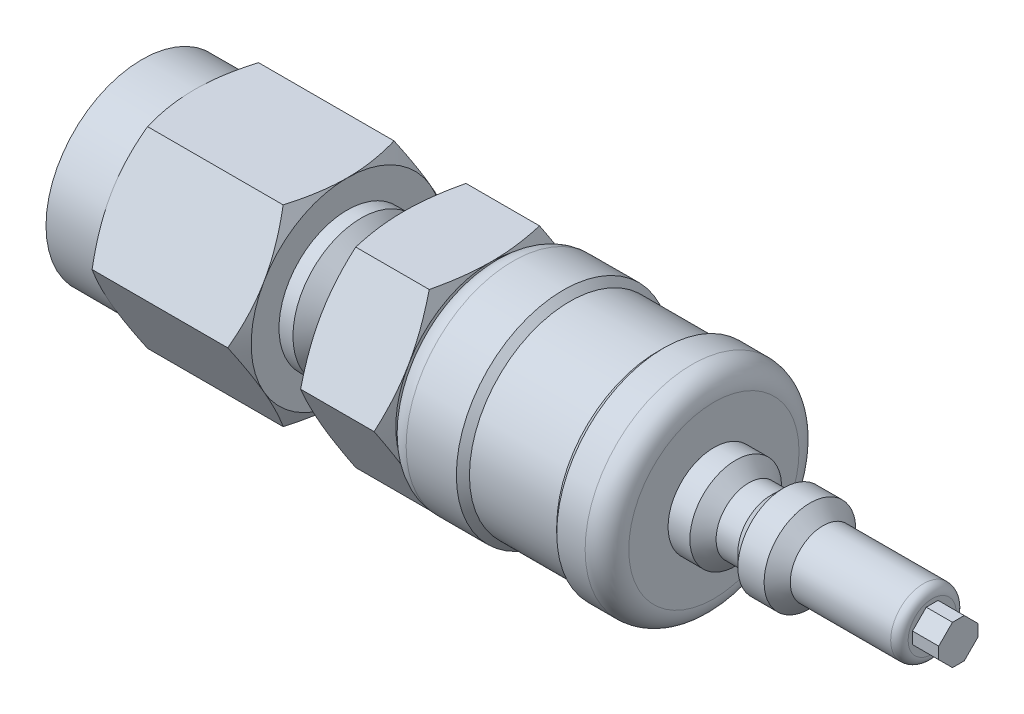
ISO-10303-21;
HEADER;
FILE_DESCRIPTION(('STEP AP214'),'2;1');
FILE_NAME('part.step','',(''),(''),'','','');
FILE_SCHEMA(('AUTOMOTIVE_DESIGN { 1 0 10303 214 1 1 1 1 }'));
ENDSEC;
DATA;
#1=APPLICATION_CONTEXT('core data for automotive mechanical design processes');
#2=APPLICATION_PROTOCOL_DEFINITION('international standard','automotive_design',2000,#1);
#3=PRODUCT_CONTEXT('',#1,'mechanical');
#4=PRODUCT('Part','Part','',(#3));
#5=PRODUCT_RELATED_PRODUCT_CATEGORY('part','',(#4));
#6=PRODUCT_DEFINITION_FORMATION('','',#4);
#7=PRODUCT_DEFINITION_CONTEXT('part definition',#1,'design');
#8=PRODUCT_DEFINITION('design','',#6,#7);
#9=PRODUCT_DEFINITION_SHAPE('','',#8);
#10=(LENGTH_UNIT() NAMED_UNIT(*) SI_UNIT(.MILLI.,.METRE.));
#11=(NAMED_UNIT(*) PLANE_ANGLE_UNIT() SI_UNIT($,.RADIAN.));
#12=(NAMED_UNIT(*) SI_UNIT($,.STERADIAN.) SOLID_ANGLE_UNIT());
#13=UNCERTAINTY_MEASURE_WITH_UNIT(LENGTH_MEASURE(1.E-05),#10,'distance_accuracy_value','');
#14=(GEOMETRIC_REPRESENTATION_CONTEXT(3) GLOBAL_UNCERTAINTY_ASSIGNED_CONTEXT((#13)) GLOBAL_UNIT_ASSIGNED_CONTEXT((#10,
#11,#12)) REPRESENTATION_CONTEXT('',''));
#15=CARTESIAN_POINT('',(0.,0.,0.));
#16=DIRECTION('',(0.,0.,1.));
#17=DIRECTION('',(1.,0.,0.));
#18=AXIS2_PLACEMENT_3D('',#15,#16,#17);
#19=CARTESIAN_POINT('',(20.32,0.,-2.4765));
#20=DIRECTION('',(-1.,0.,0.));
#21=DIRECTION('',(0.,0.,1.));
#22=AXIS2_PLACEMENT_3D('',#19,#20,#21);
#23=PLANE('',#22);
#24=CARTESIAN_POINT('',(20.32,0.,0.));
#25=DIRECTION('',(-1.,0.,0.));
#26=DIRECTION('',(0.,0.,1.));
#27=AXIS2_PLACEMENT_3D('',#24,#25,#26);
#28=CIRCLE('',#27,1.143);
#29=CARTESIAN_POINT('',(20.32,0.,1.143));
#30=VERTEX_POINT('',#29);
#31=EDGE_CURVE('E19',#30,#30,#28,.T.);
#32=ORIENTED_EDGE('',*,*,#31,.T.);
#33=EDGE_LOOP('',(#32));
#34=FACE_BOUND('',#33,.T.);
#35=ADVANCED_FACE('F16',(#34),#23,.T.);
#36=CARTESIAN_POINT('',(7.62,0.,0.));
#37=DIRECTION('',(-1.,0.,0.));
#38=DIRECTION('',(0.,0.,1.));
#39=AXIS2_PLACEMENT_3D('',#36,#37,#38);
#40=CYLINDRICAL_SURFACE('',#39,1.143);
#41=ORIENTED_EDGE('',*,*,#31,.F.);
#42=EDGE_LOOP('',(#41));
#43=FACE_BOUND('',#42,.T.);
#44=CARTESIAN_POINT('',(12.7,0.,0.));
#45=DIRECTION('',(-1.,0.,0.));
#46=DIRECTION('',(0.,0.,1.));
#47=AXIS2_PLACEMENT_3D('',#44,#45,#46);
#48=CIRCLE('',#47,1.143);
#49=CARTESIAN_POINT('',(12.7,0.,1.143));
#50=VERTEX_POINT('',#49);
#51=EDGE_CURVE('E1212',#50,#50,#48,.T.);
#52=ORIENTED_EDGE('',*,*,#51,.T.);
#53=EDGE_LOOP('',(#52));
#54=FACE_BOUND('',#53,.T.);
#55=ADVANCED_FACE('F1284',(#43,#54),#40,.F.);
#56=CARTESIAN_POINT('',(12.7,0.,0.));
#57=DIRECTION('',(1.,0.,0.));
#58=DIRECTION('',(0.,1.,0.));
#59=AXIS2_PLACEMENT_3D('',#56,#57,#58);
#60=PLANE('',#59);
#61=CARTESIAN_POINT('',(12.7,0.,0.));
#62=DIRECTION('',(1.,0.,0.));
#63=DIRECTION('',(0.,0.,-1.));
#64=AXIS2_PLACEMENT_3D('',#61,#62,#63);
#65=CIRCLE('',#64,1.651);
#66=CARTESIAN_POINT('',(12.7,0.,-1.651));
#67=VERTEX_POINT('',#66);
#68=EDGE_CURVE('E1252',#67,#67,#65,.F.);
#69=ORIENTED_EDGE('',*,*,#68,.T.);
#70=EDGE_LOOP('',(#69));
#71=FACE_BOUND('',#70,.T.);
#72=ORIENTED_EDGE('',*,*,#51,.F.);
#73=EDGE_LOOP('',(#72));
#74=FACE_BOUND('',#73,.T.);
#75=ADVANCED_FACE('F1267',(#71,#74),#60,.F.);
#76=CARTESIAN_POINT('',(6.35,0.,0.));
#77=DIRECTION('',(1.,0.,0.));
#78=DIRECTION('',(0.,0.,-1.));
#79=AXIS2_PLACEMENT_3D('',#76,#77,#78);
#80=CYLINDRICAL_SURFACE('',#79,1.651);
#81=CARTESIAN_POINT('',(0.,0.,0.));
#82=DIRECTION('',(1.,0.,0.));
#83=DIRECTION('',(0.,0.,-1.));
#84=AXIS2_PLACEMENT_3D('',#81,#82,#83);
#85=CIRCLE('',#84,1.651);
#86=CARTESIAN_POINT('',(0.,0.,-1.651));
#87=VERTEX_POINT('',#86);
#88=EDGE_CURVE('E1249',#87,#87,#85,.T.);
#89=ORIENTED_EDGE('',*,*,#88,.F.);
#90=EDGE_LOOP('',(#89));
#91=FACE_BOUND('',#90,.T.);
#92=ORIENTED_EDGE('',*,*,#68,.F.);
#93=EDGE_LOOP('',(#92));
#94=FACE_BOUND('',#93,.T.);
#95=ADVANCED_FACE('F1270',(#91,#94),#80,.F.);
#96=CARTESIAN_POINT('',(0.,0.,2.794));
#97=DIRECTION('',(-1.,0.,0.));
#98=DIRECTION('',(0.,0.,1.));
#99=AXIS2_PLACEMENT_3D('',#96,#97,#98);
#100=PLANE('',#99);
#101=CARTESIAN_POINT('',(0.,0.,0.));
#102=DIRECTION('',(1.,0.,0.));
#103=DIRECTION('',(0.,0.,-1.));
#104=AXIS2_PLACEMENT_3D('',#101,#102,#103);
#105=CIRCLE('',#104,5.588);
#106=CARTESIAN_POINT('',(0.,0.,-5.588));
#107=VERTEX_POINT('',#106);
#108=EDGE_CURVE('E704',#107,#107,#105,.T.);
#109=ORIENTED_EDGE('',*,*,#108,.F.);
#110=EDGE_LOOP('',(#109));
#111=FACE_BOUND('',#110,.T.);
#112=ORIENTED_EDGE('',*,*,#88,.T.);
#113=EDGE_LOOP('',(#112));
#114=FACE_BOUND('',#113,.T.);
#115=ADVANCED_FACE('F1272',(#111,#114),#100,.T.);
#116=CARTESIAN_POINT('',(7.493,0.,0.));
#117=DIRECTION('',(1.,0.,0.));
#118=DIRECTION('',(0.,0.,-1.));
#119=AXIS2_PLACEMENT_3D('',#116,#117,#118);
#120=CYLINDRICAL_SURFACE('',#119,5.588);
#121=CARTESIAN_POINT('',(3.04800000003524,0.,0.));
#122=DIRECTION('',(1.,0.,0.));
#123=DIRECTION('',(0.,0.,-1.));
#124=AXIS2_PLACEMENT_3D('',#121,#122,#123);
#125=CIRCLE('',#124,5.58799999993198);
#126=CARTESIAN_POINT('',(3.04800000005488,-5.58799999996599,0.));
#127=VERTEX_POINT('',#126);
#128=CARTESIAN_POINT('',(3.04800000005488,-2.793999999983,4.83934995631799));
#129=VERTEX_POINT('',#128);
#130=EDGE_CURVE('E677',#127,#129,#125,.F.);
#131=ORIENTED_EDGE('',*,*,#130,.T.);
#132=CARTESIAN_POINT('',(3.04800000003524,0.,0.));
#133=DIRECTION('',(1.,0.,0.));
#134=DIRECTION('',(0.,0.,-1.));
#135=AXIS2_PLACEMENT_3D('',#132,#133,#134);
#136=CIRCLE('',#135,5.58799999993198);
#137=CARTESIAN_POINT('',(3.04800000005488,2.793999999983,4.83934995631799));
#138=VERTEX_POINT('',#137);
#139=EDGE_CURVE('E234',#129,#138,#136,.F.);
#140=ORIENTED_EDGE('',*,*,#139,.T.);
#141=CARTESIAN_POINT('',(3.04800000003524,0.,0.));
#142=DIRECTION('',(1.,0.,0.));
#143=DIRECTION('',(0.,0.,-1.));
#144=AXIS2_PLACEMENT_3D('',#141,#142,#143);
#145=CIRCLE('',#144,5.58799999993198);
#146=CARTESIAN_POINT('',(3.04800000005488,5.58799999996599,0.));
#147=VERTEX_POINT('',#146);
#148=EDGE_CURVE('E664',#138,#147,#145,.F.);
#149=ORIENTED_EDGE('',*,*,#148,.T.);
#150=CARTESIAN_POINT('',(3.04800000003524,0.,0.));
#151=DIRECTION('',(1.,0.,0.));
#152=DIRECTION('',(0.,0.,-1.));
#153=AXIS2_PLACEMENT_3D('',#150,#151,#152);
#154=CIRCLE('',#153,5.58799999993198);
#155=CARTESIAN_POINT('',(3.04800000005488,2.79399999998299,-4.83934995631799));
#156=VERTEX_POINT('',#155);
#157=EDGE_CURVE('E660',#147,#156,#154,.F.);
#158=ORIENTED_EDGE('',*,*,#157,.T.);
#159=CARTESIAN_POINT('',(3.04800000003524,0.,0.));
#160=DIRECTION('',(1.,0.,0.));
#161=DIRECTION('',(0.,0.,-1.));
#162=AXIS2_PLACEMENT_3D('',#159,#160,#161);
#163=CIRCLE('',#162,5.58799999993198);
#164=CARTESIAN_POINT('',(3.04800000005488,-2.793999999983,-4.83934995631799));
#165=VERTEX_POINT('',#164);
#166=EDGE_CURVE('E668',#156,#165,#163,.F.);
#167=ORIENTED_EDGE('',*,*,#166,.T.);
#168=CARTESIAN_POINT('',(3.04800000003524,0.,0.));
#169=DIRECTION('',(1.,0.,0.));
#170=DIRECTION('',(0.,0.,-1.));
#171=AXIS2_PLACEMENT_3D('',#168,#169,#170);
#172=CIRCLE('',#171,5.58799999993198);
#173=EDGE_CURVE('E672',#165,#127,#172,.F.);
#174=ORIENTED_EDGE('',*,*,#173,.T.);
#175=EDGE_LOOP('',(#131,#140,#149,#158,#167,#174));
#176=FACE_BOUND('',#175,.T.);
#177=ORIENTED_EDGE('',*,*,#108,.T.);
#178=EDGE_LOOP('',(#177));
#179=FACE_BOUND('',#178,.T.);
#180=ADVANCED_FACE('F1280',(#176,#179),#120,.T.);
#181=CARTESIAN_POINT('',(45.974,1.143,0.3429));
#182=DIRECTION('',(0.,1.,0.));
#183=DIRECTION('',(0.,0.,1.));
#184=AXIS2_PLACEMENT_3D('',#181,#182,#183);
#185=PLANE('',#184);
#186=DIRECTION('',(0.,0.,1.));
#187=VECTOR('',#186,1.);
#188=CARTESIAN_POINT('',(45.974,1.143,0.3429));
#189=LINE('',#188,#187);
#190=CARTESIAN_POINT('',(45.974,1.143,-0.3429));
#191=VERTEX_POINT('',#190);
#192=CARTESIAN_POINT('',(45.974,1.143,0.3429));
#193=VERTEX_POINT('',#192);
#194=EDGE_CURVE('E700',#191,#193,#189,.T.);
#195=ORIENTED_EDGE('',*,*,#194,.T.);
#196=DIRECTION('',(1.,0.,0.));
#197=VECTOR('',#196,1.);
#198=CARTESIAN_POINT('',(45.974,1.143,0.3429));
#199=LINE('',#198,#197);
#200=CARTESIAN_POINT('',(47.498,1.143,0.3429));
#201=VERTEX_POINT('',#200);
#202=EDGE_CURVE('E654',#201,#193,#199,.F.);
#203=ORIENTED_EDGE('',*,*,#202,.F.);
#204=DIRECTION('',(0.,0.,1.));
#205=VECTOR('',#204,1.);
#206=CARTESIAN_POINT('',(47.498,1.143,-0.285749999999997));
#207=LINE('',#206,#205);
#208=CARTESIAN_POINT('',(47.498,1.143,-0.3429));
#209=VERTEX_POINT('',#208);
#210=EDGE_CURVE('E680',#209,#201,#207,.T.);
#211=ORIENTED_EDGE('',*,*,#210,.F.);
#212=DIRECTION('',(1.,0.,0.));
#213=VECTOR('',#212,1.);
#214=CARTESIAN_POINT('',(45.974,1.143,-0.3429));
#215=LINE('',#214,#213);
#216=EDGE_CURVE('E642',#191,#209,#215,.T.);
#217=ORIENTED_EDGE('',*,*,#216,.F.);
#218=EDGE_LOOP('',(#195,#203,#211,#217));
#219=FACE_BOUND('',#218,.T.);
#220=ADVANCED_FACE('F1340',(#219),#185,.T.);
#221=CARTESIAN_POINT('',(45.974,0.3429,-1.143));
#222=DIRECTION('',(0.,0.,-1.));
#223=DIRECTION('',(-1.,0.,0.));
#224=AXIS2_PLACEMENT_3D('',#221,#222,#223);
#225=PLANE('',#224);
#226=DIRECTION('',(0.,1.,0.));
#227=VECTOR('',#226,1.);
#228=CARTESIAN_POINT('',(45.974,0.3429,-1.143));
#229=LINE('',#228,#227);
#230=CARTESIAN_POINT('',(45.974,-0.3429,-1.143));
#231=VERTEX_POINT('',#230);
#232=CARTESIAN_POINT('',(45.974,0.3429,-1.143));
#233=VERTEX_POINT('',#232);
#234=EDGE_CURVE('E696',#231,#233,#229,.T.);
#235=ORIENTED_EDGE('',*,*,#234,.T.);
#236=DIRECTION('',(1.,0.,0.));
#237=VECTOR('',#236,1.);
#238=CARTESIAN_POINT('',(45.974,0.3429,-1.143));
#239=LINE('',#238,#237);
#240=CARTESIAN_POINT('',(47.498,0.3429,-1.143));
#241=VERTEX_POINT('',#240);
#242=EDGE_CURVE('E646',#241,#233,#239,.F.);
#243=ORIENTED_EDGE('',*,*,#242,.F.);
#244=DIRECTION('',(0.,1.,0.));
#245=VECTOR('',#244,1.);
#246=CARTESIAN_POINT('',(47.498,0.,-1.143));
#247=LINE('',#246,#245);
#248=CARTESIAN_POINT('',(47.498,-0.3429,-1.143));
#249=VERTEX_POINT('',#248);
#250=EDGE_CURVE('E684',#249,#241,#247,.T.);
#251=ORIENTED_EDGE('',*,*,#250,.F.);
#252=DIRECTION('',(1.,0.,0.));
#253=VECTOR('',#252,1.);
#254=CARTESIAN_POINT('',(45.974,-0.3429,-1.143));
#255=LINE('',#254,#253);
#256=EDGE_CURVE('E630',#231,#249,#255,.T.);
#257=ORIENTED_EDGE('',*,*,#256,.F.);
#258=EDGE_LOOP('',(#235,#243,#251,#257));
#259=FACE_BOUND('',#258,.T.);
#260=ADVANCED_FACE('F1349',(#259),#225,.T.);
#261=CARTESIAN_POINT('',(45.974,-1.143,-0.3429));
#262=DIRECTION('',(0.,-1.,0.));
#263=DIRECTION('',(0.,0.,-1.));
#264=AXIS2_PLACEMENT_3D('',#261,#262,#263);
#265=PLANE('',#264);
#266=DIRECTION('',(0.,0.,-1.));
#267=VECTOR('',#266,1.);
#268=CARTESIAN_POINT('',(45.974,-1.143,-0.3429));
#269=LINE('',#268,#267);
#270=CARTESIAN_POINT('',(45.974,-1.143,0.3429));
#271=VERTEX_POINT('',#270);
#272=CARTESIAN_POINT('',(45.974,-1.143,-0.3429));
#273=VERTEX_POINT('',#272);
#274=EDGE_CURVE('E692',#271,#273,#269,.T.);
#275=ORIENTED_EDGE('',*,*,#274,.T.);
#276=DIRECTION('',(1.,0.,0.));
#277=VECTOR('',#276,1.);
#278=CARTESIAN_POINT('',(45.974,-1.143,-0.3429));
#279=LINE('',#278,#277);
#280=CARTESIAN_POINT('',(47.498,-1.143,-0.3429));
#281=VERTEX_POINT('',#280);
#282=EDGE_CURVE('E634',#281,#273,#279,.F.);
#283=ORIENTED_EDGE('',*,*,#282,.F.);
#284=DIRECTION('',(0.,0.,1.));
#285=VECTOR('',#284,1.);
#286=CARTESIAN_POINT('',(47.498,-1.143,-0.285749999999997));
#287=LINE('',#286,#285);
#288=CARTESIAN_POINT('',(47.498,-1.143,0.3429));
#289=VERTEX_POINT('',#288);
#290=EDGE_CURVE('E688',#289,#281,#287,.F.);
#291=ORIENTED_EDGE('',*,*,#290,.F.);
#292=DIRECTION('',(1.,0.,0.));
#293=VECTOR('',#292,1.);
#294=CARTESIAN_POINT('',(45.974,-1.143,0.3429));
#295=LINE('',#294,#293);
#296=EDGE_CURVE('E622',#271,#289,#295,.T.);
#297=ORIENTED_EDGE('',*,*,#296,.F.);
#298=EDGE_LOOP('',(#275,#283,#291,#297));
#299=FACE_BOUND('',#298,.T.);
#300=ADVANCED_FACE('F1359',(#299),#265,.T.);
#301=CARTESIAN_POINT('',(47.498,0.,-0.285749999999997));
#302=DIRECTION('',(1.,0.,0.));
#303=DIRECTION('',(0.,1.,0.));
#304=AXIS2_PLACEMENT_3D('',#301,#302,#303);
#305=PLANE('',#304);
#306=DIRECTION('',(0.,0.707106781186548,0.707106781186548));
#307=VECTOR('',#306,1.);
#308=CARTESIAN_POINT('',(47.498,1.143,-0.3429));
#309=LINE('',#308,#307);
#310=EDGE_CURVE('E650',#209,#241,#309,.F.);
#311=ORIENTED_EDGE('',*,*,#310,.F.);
#312=ORIENTED_EDGE('',*,*,#210,.T.);
#313=DIRECTION('',(0.,-0.707106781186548,0.707106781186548));
#314=VECTOR('',#313,1.);
#315=CARTESIAN_POINT('',(47.498,0.3429,1.143));
#316=LINE('',#315,#314);
#317=CARTESIAN_POINT('',(47.498,0.3429,1.143));
#318=VERTEX_POINT('',#317);
#319=EDGE_CURVE('E657',#318,#201,#316,.F.);
#320=ORIENTED_EDGE('',*,*,#319,.F.);
#321=DIRECTION('',(0.,1.,0.));
#322=VECTOR('',#321,1.);
#323=CARTESIAN_POINT('',(47.498,0.,1.143));
#324=LINE('',#323,#322);
#325=CARTESIAN_POINT('',(47.498,-0.3429,1.143));
#326=VERTEX_POINT('',#325);
#327=EDGE_CURVE('E618',#326,#318,#324,.T.);
#328=ORIENTED_EDGE('',*,*,#327,.F.);
#329=DIRECTION('',(0.,-0.707106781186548,-0.707106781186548));
#330=VECTOR('',#329,1.);
#331=CARTESIAN_POINT('',(47.498,-1.143,0.3429));
#332=LINE('',#331,#330);
#333=EDGE_CURVE('E626',#289,#326,#332,.F.);
#334=ORIENTED_EDGE('',*,*,#333,.F.);
#335=ORIENTED_EDGE('',*,*,#290,.T.);
#336=DIRECTION('',(0.,0.707106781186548,-0.707106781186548));
#337=VECTOR('',#336,1.);
#338=CARTESIAN_POINT('',(47.498,-0.3429,-1.143));
#339=LINE('',#338,#337);
#340=EDGE_CURVE('E638',#249,#281,#339,.F.);
#341=ORIENTED_EDGE('',*,*,#340,.F.);
#342=ORIENTED_EDGE('',*,*,#250,.T.);
#343=EDGE_LOOP('',(#311,#312,#320,#328,#334,#335,#341,#342));
#344=FACE_BOUND('',#343,.T.);
#345=ADVANCED_FACE('F1370',(#344),#305,.T.);
#346=CARTESIAN_POINT('',(3.04800000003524,0.,0.));
#347=DIRECTION('',(1.,0.,0.));
#348=DIRECTION('',(0.,0.,-1.));
#349=AXIS2_PLACEMENT_3D('',#346,#347,#348);
#350=CONICAL_SURFACE('',#349,5.58799999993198,1.04719755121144);
#351=CARTESIAN_POINT('',(3.04800000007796,-2.79399999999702,4.83934995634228));
#352=CARTESIAN_POINT('',(3.04797716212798,-2.91258962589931,4.77088220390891));
#353=CARTESIAN_POINT('',(3.05090552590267,-3.03117353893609,4.70241774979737));
#354=CARTESIAN_POINT('',(3.06249491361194,-3.26810852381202,4.56562327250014));
#355=CARTESIAN_POINT('',(3.07115480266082,-3.38645963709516,4.49729322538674));
#356=CARTESIAN_POINT('',(3.09398047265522,-3.62216456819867,4.36120891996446));
#357=CARTESIAN_POINT('',(3.10811853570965,-3.73952041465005,4.2934534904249));
#358=CARTESIAN_POINT('',(3.14159643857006,-3.9736729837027,4.15826544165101));
#359=CARTESIAN_POINT('',(3.16093641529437,-4.09046969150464,4.09083283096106));
#360=CARTESIAN_POINT('',(3.22616175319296,-4.43953697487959,3.88929874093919));
#361=CARTESIAN_POINT('',(3.27928419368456,-4.67079349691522,3.75578272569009));
#362=CARTESIAN_POINT('',(3.4017981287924,-5.13131783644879,3.48989887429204));
#363=CARTESIAN_POINT('',(3.47127087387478,-5.36056959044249,3.3575403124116));
#364=CARTESIAN_POINT('',(3.54710002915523,-5.58799999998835,3.22623330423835));
#365=B_SPLINE_CURVE_WITH_KNOTS('',3,(#351,#352,#353,#354,#355,#356,#357,#358,#359,#360,#361,
#362,#363,#364),.UNSPECIFIED.,.F.,.F.,(4,2,2,2,2,2,4),(0.,0.410764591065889,0.821447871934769,
1.23007979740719,1.6387224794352,2.45493679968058,3.27529616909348),.UNSPECIFIED.);
#366=CARTESIAN_POINT('',(3.5471000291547,-5.58799999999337,3.2262333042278));
#367=VERTEX_POINT('',#366);
#368=EDGE_CURVE('E238',#129,#367,#365,.T.);
#369=ORIENTED_EDGE('',*,*,#368,.F.);
#370=ORIENTED_EDGE('',*,*,#130,.F.);
#371=CARTESIAN_POINT('',(3.54710002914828,-5.58800000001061,3.22623330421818));
#372=CARTESIAN_POINT('',(3.47127087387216,-5.5880000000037,2.96361928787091));
#373=CARTESIAN_POINT('',(3.40179812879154,-5.58800000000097,2.69890216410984));
#374=CARTESIAN_POINT('',(3.279284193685,-5.58799999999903,2.16713446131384));
#375=CARTESIAN_POINT('',(3.22616175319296,-5.58799999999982,1.9001024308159));
#376=CARTESIAN_POINT('',(3.16093641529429,-5.58800000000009,1.49703425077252));
#377=CARTESIAN_POINT('',(3.14159643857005,-5.58800000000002,1.36216902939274));
#378=CARTESIAN_POINT('',(3.10811853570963,-5.58799999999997,1.09179293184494));
#379=CARTESIAN_POINT('',(3.09398047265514,-5.58799999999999,0.956282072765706));
#380=CARTESIAN_POINT('',(3.07115480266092,-5.588,0.684113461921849));
#381=CARTESIAN_POINT('',(3.06249491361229,-5.588,0.547453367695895));
#382=CARTESIAN_POINT('',(3.05090552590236,-5.58799999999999,0.273864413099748));
#383=CARTESIAN_POINT('',(3.04797716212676,-5.58799999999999,0.136935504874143));
#384=CARTESIAN_POINT('',(3.04800000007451,-5.588,9.91822822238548E-13));
#385=B_SPLINE_CURVE_WITH_KNOTS('',3,(#371,#372,#373,#374,#375,#376,#377,#378,#379,#380,#381,
#382,#383,#384),.UNSPECIFIED.,.F.,.F.,(4,2,2,2,2,2,4),(0.,0.820359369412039,1.63657368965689,
2.04521637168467,2.45384829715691,2.86453157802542,3.27529616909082),.UNSPECIFIED.);
#386=EDGE_CURVE('E526',#367,#127,#385,.T.);
#387=ORIENTED_EDGE('',*,*,#386,.F.);
#388=EDGE_LOOP('',(#369,#370,#387));
#389=FACE_BOUND('',#388,.T.);
#390=ADVANCED_FACE('F536',(#389),#350,.T.);
#391=CARTESIAN_POINT('',(3.04800000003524,0.,0.));
#392=DIRECTION('',(1.,0.,0.));
#393=DIRECTION('',(0.,0.,-1.));
#394=AXIS2_PLACEMENT_3D('',#391,#392,#393);
#395=CONICAL_SURFACE('',#394,5.58799999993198,1.04719755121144);
#396=ORIENTED_EDGE('',*,*,#173,.F.);
#397=CARTESIAN_POINT('',(3.54710002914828,-5.58799999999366,-3.22623330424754));
#398=CARTESIAN_POINT('',(3.47127087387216,-5.36056959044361,-3.3575403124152));
#399=CARTESIAN_POINT('',(3.40179812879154,-5.13131783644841,-3.48989887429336));
#400=CARTESIAN_POINT('',(3.279284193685,-4.670793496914,-3.75578272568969));
#401=CARTESIAN_POINT('',(3.22616175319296,-4.43953697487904,-3.88929874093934));
#402=CARTESIAN_POINT('',(3.16093641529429,-4.09046969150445,-4.09083283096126));
#403=CARTESIAN_POINT('',(3.14159643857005,-3.97367298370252,-4.15826544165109));
#404=CARTESIAN_POINT('',(3.10811853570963,-3.73952041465,-4.29345349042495));
#405=CARTESIAN_POINT('',(3.09398047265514,-3.62216456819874,-4.36120891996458));
#406=CARTESIAN_POINT('',(3.07115480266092,-3.38645963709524,-4.49729322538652));
#407=CARTESIAN_POINT('',(3.06249491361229,-3.26810852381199,-4.5656232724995));
#408=CARTESIAN_POINT('',(3.05090552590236,-3.0311735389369,-4.70241774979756));
#409=CARTESIAN_POINT('',(3.04797716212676,-2.91258962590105,-4.77088220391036));
#410=CARTESIAN_POINT('',(3.04800000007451,-2.79400000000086,-4.83934995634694));
#411=B_SPLINE_CURVE_WITH_KNOTS('',3,(#397,#398,#399,#400,#401,#402,#403,#404,#405,#406,#407,
#408,#409,#410),.UNSPECIFIED.,.F.,.F.,(4,2,2,2,2,2,4),(0.,0.820359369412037,1.63657368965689,
2.04521637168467,2.45384829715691,2.86453157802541,3.27529616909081),.UNSPECIFIED.);
#412=CARTESIAN_POINT('',(3.5471000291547,-5.58799999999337,-3.2262333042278));
#413=VERTEX_POINT('',#412);
#414=EDGE_CURVE('E518',#413,#165,#411,.T.);
#415=ORIENTED_EDGE('',*,*,#414,.F.);
#416=CARTESIAN_POINT('',(3.04800000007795,-5.58799999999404,0.));
#417=CARTESIAN_POINT('',(3.04797716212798,-5.58799999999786,-0.136935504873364));
#418=CARTESIAN_POINT('',(3.05090552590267,-5.58799999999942,-0.273864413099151));
#419=CARTESIAN_POINT('',(3.06249491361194,-5.58800000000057,-0.547453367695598));
#420=CARTESIAN_POINT('',(3.07115480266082,-5.58800000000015,-0.684113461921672));
#421=CARTESIAN_POINT('',(3.09398047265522,-5.58799999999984,-0.95628207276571));
#422=CARTESIAN_POINT('',(3.10811853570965,-5.58799999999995,-1.09179293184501));
#423=CARTESIAN_POINT('',(3.14159643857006,-5.58800000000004,-1.36216902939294));
#424=CARTESIAN_POINT('',(3.16093641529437,-5.58800000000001,-1.49703425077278));
#425=CARTESIAN_POINT('',(3.22616175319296,-5.58799999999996,-1.90010243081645));
#426=CARTESIAN_POINT('',(3.27928419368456,-5.58799999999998,-2.16713446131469));
#427=CARTESIAN_POINT('',(3.4017981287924,-5.58800000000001,-2.69890216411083));
#428=CARTESIAN_POINT('',(3.47127087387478,-5.58800000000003,-2.96361928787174));
#429=CARTESIAN_POINT('',(3.54710002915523,-5.588,-3.22623330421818));
#430=B_SPLINE_CURVE_WITH_KNOTS('',3,(#416,#417,#418,#419,#420,#421,#422,#423,#424,#425,#426,
#427,#428,#429),.UNSPECIFIED.,.F.,.F.,(4,2,2,2,2,2,4),(0.,0.410764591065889,0.82144787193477,
1.23007979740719,1.6387224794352,2.45493679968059,3.27529616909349),.UNSPECIFIED.);
#431=EDGE_CURVE('E542',#127,#413,#430,.T.);
#432=ORIENTED_EDGE('',*,*,#431,.F.);
#433=EDGE_LOOP('',(#396,#415,#432));
#434=FACE_BOUND('',#433,.T.);
#435=ADVANCED_FACE('F532',(#434),#395,.T.);
#436=CARTESIAN_POINT('',(3.04800000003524,0.,0.));
#437=DIRECTION('',(1.,0.,0.));
#438=DIRECTION('',(0.,0.,-1.));
#439=AXIS2_PLACEMENT_3D('',#436,#437,#438);
#440=CONICAL_SURFACE('',#439,5.58799999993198,1.04719755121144);
#441=ORIENTED_EDGE('',*,*,#166,.F.);
#442=CARTESIAN_POINT('',(3.54710002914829,1.69508603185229E-11,-6.45246660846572));
#443=CARTESIAN_POINT('',(3.47127087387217,0.227430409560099,-6.32115960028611));
#444=CARTESIAN_POINT('',(3.40179812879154,0.456682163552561,-6.1888010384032));
#445=CARTESIAN_POINT('',(3.279284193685,0.91720650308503,-5.92291718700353));
#446=CARTESIAN_POINT('',(3.22616175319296,1.14846302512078,-5.78940117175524));
#447=CARTESIAN_POINT('',(3.16093641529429,1.49753030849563,-5.58786708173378));
#448=CARTESIAN_POINT('',(3.14159643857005,1.6143270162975,-5.52043447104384));
#449=CARTESIAN_POINT('',(3.10811853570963,1.84847958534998,-5.38524642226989));
#450=CARTESIAN_POINT('',(3.09398047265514,1.96583543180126,-5.31749099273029));
#451=CARTESIAN_POINT('',(3.07115480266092,2.20154036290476,-5.18140668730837));
#452=CARTESIAN_POINT('',(3.06249491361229,2.31989147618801,-5.11307664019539));
#453=CARTESIAN_POINT('',(3.05090552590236,2.5568264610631,-4.97628216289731));
#454=CARTESIAN_POINT('',(3.04797716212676,2.67541037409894,-4.90781770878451));
#455=CARTESIAN_POINT('',(3.04800000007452,2.79399999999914,-4.83934995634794));
#456=B_SPLINE_CURVE_WITH_KNOTS('',3,(#442,#443,#444,#445,#446,#447,#448,#449,#450,#451,#452,
#453,#454,#455),.UNSPECIFIED.,.F.,.F.,(4,2,2,2,2,2,4),(0.,0.820359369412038,1.63657368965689,
2.04521637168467,2.45384829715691,2.86453157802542,3.27529616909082),.UNSPECIFIED.);
#457=CARTESIAN_POINT('',(3.5471000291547,0.,-6.45246660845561));
#458=VERTEX_POINT('',#457);
#459=EDGE_CURVE('E608',#458,#156,#456,.T.);
#460=ORIENTED_EDGE('',*,*,#459,.F.);
#461=CARTESIAN_POINT('',(3.04800000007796,-2.79399999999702,-4.83934995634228));
#462=CARTESIAN_POINT('',(3.04797716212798,-2.67541037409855,-4.90781770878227));
#463=CARTESIAN_POINT('',(3.05090552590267,-2.55682646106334,-4.97628216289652));
#464=CARTESIAN_POINT('',(3.06249491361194,-2.31989147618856,-5.11307664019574));
#465=CARTESIAN_POINT('',(3.07115480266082,-2.20154036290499,-5.18140668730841));
#466=CARTESIAN_POINT('',(3.09398047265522,-1.96583543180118,-5.31749099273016));
#467=CARTESIAN_POINT('',(3.10811853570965,-1.84847958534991,-5.38524642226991));
#468=CARTESIAN_POINT('',(3.14159643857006,-1.61432701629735,-5.52043447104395));
#469=CARTESIAN_POINT('',(3.16093641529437,-1.49753030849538,-5.58786708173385));
#470=CARTESIAN_POINT('',(3.22616175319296,-1.14846302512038,-5.78940117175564));
#471=CARTESIAN_POINT('',(3.27928419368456,-0.917206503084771,-5.92291718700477));
#472=CARTESIAN_POINT('',(3.4017981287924,-0.456682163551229,-6.18880103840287));
#473=CARTESIAN_POINT('',(3.47127087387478,-0.227430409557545,-6.32115960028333));
#474=CARTESIAN_POINT('',(3.54710002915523,-1.16457439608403E-11,-6.45246660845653));
#475=B_SPLINE_CURVE_WITH_KNOTS('',3,(#461,#462,#463,#464,#465,#466,#467,#468,#469,#470,#471,
#472,#473,#474),.UNSPECIFIED.,.F.,.F.,(4,2,2,2,2,2,4),(0.,0.410764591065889,0.821447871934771,
1.23007979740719,1.6387224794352,2.45493679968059,3.27529616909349),.UNSPECIFIED.);
#476=EDGE_CURVE('E512',#165,#458,#475,.T.);
#477=ORIENTED_EDGE('',*,*,#476,.F.);
#478=EDGE_LOOP('',(#441,#460,#477));
#479=FACE_BOUND('',#478,.T.);
#480=ADVANCED_FACE('F535',(#479),#440,.T.);
#481=CARTESIAN_POINT('',(3.04800000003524,0.,0.));
#482=DIRECTION('',(1.,0.,0.));
#483=DIRECTION('',(0.,0.,-1.));
#484=AXIS2_PLACEMENT_3D('',#481,#482,#483);
#485=CONICAL_SURFACE('',#484,5.58799999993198,1.04719755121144);
#486=CARTESIAN_POINT('',(3.04800000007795,2.79399999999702,4.83934995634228));
#487=CARTESIAN_POINT('',(3.04797716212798,2.67541037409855,4.90781770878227));
#488=CARTESIAN_POINT('',(3.05090552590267,2.55682646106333,4.97628216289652));
#489=CARTESIAN_POINT('',(3.06249491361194,2.31989147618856,5.11307664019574));
#490=CARTESIAN_POINT('',(3.07115480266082,2.20154036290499,5.18140668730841));
#491=CARTESIAN_POINT('',(3.09398047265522,1.96583543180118,5.31749099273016));
#492=CARTESIAN_POINT('',(3.10811853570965,1.84847958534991,5.38524642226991));
#493=CARTESIAN_POINT('',(3.14159643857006,1.61432701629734,5.52043447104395));
#494=CARTESIAN_POINT('',(3.16093641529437,1.49753030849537,5.58786708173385));
#495=CARTESIAN_POINT('',(3.22616175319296,1.14846302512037,5.78940117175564));
#496=CARTESIAN_POINT('',(3.27928419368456,0.917206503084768,5.92291718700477));
#497=CARTESIAN_POINT('',(3.4017981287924,0.456682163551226,6.18880103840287));
#498=CARTESIAN_POINT('',(3.47127087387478,0.227430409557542,6.32115960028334));
#499=CARTESIAN_POINT('',(3.54710002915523,1.1642088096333E-11,6.45246660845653));
#500=B_SPLINE_CURVE_WITH_KNOTS('',3,(#486,#487,#488,#489,#490,#491,#492,#493,#494,#495,#496,
#497,#498,#499),.UNSPECIFIED.,.F.,.F.,(4,2,2,2,2,2,4),(0.,0.41076459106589,0.821447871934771,
1.23007979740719,1.6387224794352,2.45493679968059,3.27529616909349),.UNSPECIFIED.);
#501=CARTESIAN_POINT('',(3.54710002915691,-6.62837568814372E-12,6.45246660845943));
#502=VERTEX_POINT('',#501);
#503=EDGE_CURVE('E232',#138,#502,#500,.T.);
#504=ORIENTED_EDGE('',*,*,#503,.F.);
#505=ORIENTED_EDGE('',*,*,#139,.F.);
#506=CARTESIAN_POINT('',(3.54710002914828,-1.69540082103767E-11,6.45246660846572));
#507=CARTESIAN_POINT('',(3.47127087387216,-0.227430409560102,6.32115960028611));
#508=CARTESIAN_POINT('',(3.40179812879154,-0.456682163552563,6.1888010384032));
#509=CARTESIAN_POINT('',(3.279284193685,-0.917206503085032,5.92291718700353));
#510=CARTESIAN_POINT('',(3.22616175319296,-1.14846302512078,5.78940117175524));
#511=CARTESIAN_POINT('',(3.16093641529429,-1.49753030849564,5.58786708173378));
#512=CARTESIAN_POINT('',(3.14159643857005,-1.6143270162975,5.52043447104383));
#513=CARTESIAN_POINT('',(3.10811853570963,-1.84847958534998,5.38524642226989));
#514=CARTESIAN_POINT('',(3.09398047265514,-1.96583543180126,5.31749099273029));
#515=CARTESIAN_POINT('',(3.07115480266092,-2.20154036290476,5.18140668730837));
#516=CARTESIAN_POINT('',(3.06249491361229,-2.31989147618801,5.11307664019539));
#517=CARTESIAN_POINT('',(3.05090552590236,-2.5568264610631,4.97628216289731));
#518=CARTESIAN_POINT('',(3.04797716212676,-2.67541037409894,4.90781770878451));
#519=CARTESIAN_POINT('',(3.04800000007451,-2.79399999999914,4.83934995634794));
#520=B_SPLINE_CURVE_WITH_KNOTS('',3,(#506,#507,#508,#509,#510,#511,#512,#513,#514,#515,#516,
#517,#518,#519),.UNSPECIFIED.,.F.,.F.,(4,2,2,2,2,2,4),(0.,0.820359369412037,1.63657368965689,
2.04521637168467,2.45384829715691,2.86453157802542,3.27529616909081),.UNSPECIFIED.);
#521=EDGE_CURVE('E228',#502,#129,#520,.T.);
#522=ORIENTED_EDGE('',*,*,#521,.F.);
#523=EDGE_LOOP('',(#504,#505,#522));
#524=FACE_BOUND('',#523,.T.);
#525=ADVANCED_FACE('F230',(#524),#485,.T.);
#526=CARTESIAN_POINT('',(3.04800000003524,0.,0.));
#527=DIRECTION('',(1.,0.,0.));
#528=DIRECTION('',(0.,0.,-1.));
#529=AXIS2_PLACEMENT_3D('',#526,#527,#528);
#530=CONICAL_SURFACE('',#529,5.58799999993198,1.04719755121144);
#531=CARTESIAN_POINT('',(3.04800000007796,5.58799999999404,0.));
#532=CARTESIAN_POINT('',(3.04797716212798,5.58799999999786,0.136935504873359));
#533=CARTESIAN_POINT('',(3.05090552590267,5.58799999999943,0.273864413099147));
#534=CARTESIAN_POINT('',(3.06249491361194,5.58800000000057,0.547453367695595));
#535=CARTESIAN_POINT('',(3.07115480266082,5.58800000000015,0.684113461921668));
#536=CARTESIAN_POINT('',(3.09398047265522,5.58799999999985,0.956282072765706));
#537=CARTESIAN_POINT('',(3.10811853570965,5.58799999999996,1.091792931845));
#538=CARTESIAN_POINT('',(3.14159643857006,5.58800000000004,1.36216902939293));
#539=CARTESIAN_POINT('',(3.16093641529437,5.58800000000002,1.49703425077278));
#540=CARTESIAN_POINT('',(3.22616175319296,5.58799999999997,1.90010243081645));
#541=CARTESIAN_POINT('',(3.27928419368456,5.58799999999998,2.16713446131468));
#542=CARTESIAN_POINT('',(3.4017981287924,5.58800000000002,2.69890216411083));
#543=CARTESIAN_POINT('',(3.47127087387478,5.58800000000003,2.96361928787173));
#544=CARTESIAN_POINT('',(3.54710002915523,5.588,3.22623330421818));
#545=B_SPLINE_CURVE_WITH_KNOTS('',3,(#531,#532,#533,#534,#535,#536,#537,#538,#539,#540,#541,
#542,#543,#544),.UNSPECIFIED.,.F.,.F.,(4,2,2,2,2,2,4),(0.,0.410764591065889,0.82144787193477,
1.23007979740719,1.6387224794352,2.45493679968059,3.27529616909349),.UNSPECIFIED.);
#546=CARTESIAN_POINT('',(3.54710002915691,5.58799999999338,3.22623330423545));
#547=VERTEX_POINT('',#546);
#548=EDGE_CURVE('E602',#147,#547,#545,.T.);
#549=ORIENTED_EDGE('',*,*,#548,.F.);
#550=ORIENTED_EDGE('',*,*,#148,.F.);
#551=CARTESIAN_POINT('',(3.54710002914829,5.58799999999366,3.22623330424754));
#552=CARTESIAN_POINT('',(3.47127087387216,5.36056959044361,3.3575403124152));
#553=CARTESIAN_POINT('',(3.40179812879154,5.13131783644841,3.48989887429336));
#554=CARTESIAN_POINT('',(3.279284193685,4.67079349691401,3.75578272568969));
#555=CARTESIAN_POINT('',(3.22616175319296,4.43953697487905,3.88929874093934));
#556=CARTESIAN_POINT('',(3.16093641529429,4.09046969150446,4.09083283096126));
#557=CARTESIAN_POINT('',(3.14159643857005,3.97367298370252,4.15826544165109));
#558=CARTESIAN_POINT('',(3.10811853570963,3.73952041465,4.29345349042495));
#559=CARTESIAN_POINT('',(3.09398047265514,3.62216456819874,4.36120891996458));
#560=CARTESIAN_POINT('',(3.07115480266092,3.38645963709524,4.49729322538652));
#561=CARTESIAN_POINT('',(3.06249491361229,3.26810852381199,4.5656232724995));
#562=CARTESIAN_POINT('',(3.05090552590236,3.0311735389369,4.70241774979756));
#563=CARTESIAN_POINT('',(3.04797716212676,2.91258962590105,4.77088220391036));
#564=CARTESIAN_POINT('',(3.04800000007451,2.79400000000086,4.83934995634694));
#565=B_SPLINE_CURVE_WITH_KNOTS('',3,(#551,#552,#553,#554,#555,#556,#557,#558,#559,#560,#561,
#562,#563,#564),.UNSPECIFIED.,.F.,.F.,(4,2,2,2,2,2,4),(0.,0.820359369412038,1.63657368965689,
2.04521637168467,2.45384829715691,2.86453157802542,3.27529616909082),.UNSPECIFIED.);
#566=EDGE_CURVE('E249',#547,#138,#565,.T.);
#567=ORIENTED_EDGE('',*,*,#566,.F.);
#568=EDGE_LOOP('',(#549,#550,#567));
#569=FACE_BOUND('',#568,.T.);
#570=ADVANCED_FACE('F1410',(#569),#530,.T.);
#571=CARTESIAN_POINT('',(3.04800000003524,0.,0.));
#572=DIRECTION('',(1.,0.,0.));
#573=DIRECTION('',(0.,0.,-1.));
#574=AXIS2_PLACEMENT_3D('',#571,#572,#573);
#575=CONICAL_SURFACE('',#574,5.58799999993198,1.04719755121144);
#576=ORIENTED_EDGE('',*,*,#157,.F.);
#577=CARTESIAN_POINT('',(3.54710002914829,5.58800000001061,-3.22623330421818));
#578=CARTESIAN_POINT('',(3.47127087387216,5.58800000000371,-2.96361928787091));
#579=CARTESIAN_POINT('',(3.40179812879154,5.58800000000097,-2.69890216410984));
#580=CARTESIAN_POINT('',(3.279284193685,5.58799999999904,-2.16713446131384));
#581=CARTESIAN_POINT('',(3.22616175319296,5.58799999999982,-1.9001024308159));
#582=CARTESIAN_POINT('',(3.16093641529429,5.58800000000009,-1.49703425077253));
#583=CARTESIAN_POINT('',(3.14159643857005,5.58800000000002,-1.36216902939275));
#584=CARTESIAN_POINT('',(3.10811853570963,5.58799999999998,-1.09179293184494));
#585=CARTESIAN_POINT('',(3.09398047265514,5.58799999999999,-0.956282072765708));
#586=CARTESIAN_POINT('',(3.07115480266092,5.58800000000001,-0.684113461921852));
#587=CARTESIAN_POINT('',(3.06249491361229,5.588,-0.547453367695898));
#588=CARTESIAN_POINT('',(3.05090552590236,5.588,-0.273864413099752));
#589=CARTESIAN_POINT('',(3.04797716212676,5.58799999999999,-0.136935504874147));
#590=CARTESIAN_POINT('',(3.04800000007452,5.588,-9.96047288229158E-13));
#591=B_SPLINE_CURVE_WITH_KNOTS('',3,(#577,#578,#579,#580,#581,#582,#583,#584,#585,#586,#587,
#588,#589,#590),.UNSPECIFIED.,.F.,.F.,(4,2,2,2,2,2,4),(0.,0.820359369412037,1.63657368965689,
2.04521637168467,2.45384829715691,2.86453157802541,3.27529616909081),.UNSPECIFIED.);
#592=CARTESIAN_POINT('',(3.5471000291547,5.58799999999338,-3.2262333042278));
#593=VERTEX_POINT('',#592);
#594=EDGE_CURVE('E318',#593,#147,#591,.T.);
#595=ORIENTED_EDGE('',*,*,#594,.F.);
#596=CARTESIAN_POINT('',(3.04800000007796,2.79399999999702,-4.83934995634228));
#597=CARTESIAN_POINT('',(3.04797716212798,2.91258962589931,-4.77088220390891));
#598=CARTESIAN_POINT('',(3.05090552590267,3.03117353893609,-4.70241774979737));
#599=CARTESIAN_POINT('',(3.06249491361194,3.26810852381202,-4.56562327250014));
#600=CARTESIAN_POINT('',(3.07115480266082,3.38645963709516,-4.49729322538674));
#601=CARTESIAN_POINT('',(3.09398047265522,3.62216456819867,-4.36120891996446));
#602=CARTESIAN_POINT('',(3.10811853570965,3.73952041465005,-4.2934534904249));
#603=CARTESIAN_POINT('',(3.14159643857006,3.9736729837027,-4.15826544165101));
#604=CARTESIAN_POINT('',(3.16093641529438,4.09046969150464,-4.09083283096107));
#605=CARTESIAN_POINT('',(3.22616175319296,4.4395369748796,-3.88929874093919));
#606=CARTESIAN_POINT('',(3.27928419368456,4.67079349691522,-3.75578272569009));
#607=CARTESIAN_POINT('',(3.4017981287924,5.13131783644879,-3.48989887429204));
#608=CARTESIAN_POINT('',(3.47127087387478,5.36056959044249,-3.3575403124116));
#609=CARTESIAN_POINT('',(3.54710002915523,5.58799999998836,-3.22623330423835));
#610=B_SPLINE_CURVE_WITH_KNOTS('',3,(#596,#597,#598,#599,#600,#601,#602,#603,#604,#605,#606,
#607,#608,#609),.UNSPECIFIED.,.F.,.F.,(4,2,2,2,2,2,4),(0.,0.410764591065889,0.82144787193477,
1.23007979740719,1.6387224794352,2.45493679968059,3.27529616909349),.UNSPECIFIED.);
#611=EDGE_CURVE('E261',#156,#593,#610,.T.);
#612=ORIENTED_EDGE('',*,*,#611,.F.);
#613=EDGE_LOOP('',(#576,#595,#612));
#614=FACE_BOUND('',#613,.T.);
#615=ADVANCED_FACE('F1418',(#614),#575,.T.);
#616=CARTESIAN_POINT('',(45.974,0.3429,1.143));
#617=DIRECTION('',(0.,0.707106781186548,0.707106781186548));
#618=DIRECTION('',(0.,-0.707106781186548,0.707106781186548));
#619=AXIS2_PLACEMENT_3D('',#616,#617,#618);
#620=PLANE('',#619);
#621=DIRECTION('',(0.,0.707106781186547,-0.707106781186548));
#622=VECTOR('',#621,1.);
#623=CARTESIAN_POINT('',(45.974,0.3429,1.143));
#624=LINE('',#623,#622);
#625=CARTESIAN_POINT('',(45.974,0.3429,1.143));
#626=VERTEX_POINT('',#625);
#627=EDGE_CURVE('E362',#626,#193,#624,.T.);
#628=ORIENTED_EDGE('',*,*,#627,.F.);
#629=DIRECTION('',(1.,0.,0.));
#630=VECTOR('',#629,1.);
#631=CARTESIAN_POINT('',(45.974,0.3429,1.143));
#632=LINE('',#631,#630);
#633=EDGE_CURVE('E614',#318,#626,#632,.F.);
#634=ORIENTED_EDGE('',*,*,#633,.F.);
#635=ORIENTED_EDGE('',*,*,#319,.T.);
#636=ORIENTED_EDGE('',*,*,#202,.T.);
#637=EDGE_LOOP('',(#628,#634,#635,#636));
#638=FACE_BOUND('',#637,.T.);
#639=ADVANCED_FACE('F1427',(#638),#620,.T.);
#640=CARTESIAN_POINT('',(45.974,1.143,-0.3429));
#641=DIRECTION('',(0.,0.707106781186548,-0.707106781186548));
#642=DIRECTION('',(0.,0.707106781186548,0.707106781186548));
#643=AXIS2_PLACEMENT_3D('',#640,#641,#642);
#644=PLANE('',#643);
#645=DIRECTION('',(0.,-0.707106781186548,-0.707106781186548));
#646=VECTOR('',#645,1.);
#647=CARTESIAN_POINT('',(45.974,1.143,-0.3429));
#648=LINE('',#647,#646);
#649=EDGE_CURVE('E358',#191,#233,#648,.T.);
#650=ORIENTED_EDGE('',*,*,#649,.F.);
#651=ORIENTED_EDGE('',*,*,#216,.T.);
#652=ORIENTED_EDGE('',*,*,#310,.T.);
#653=ORIENTED_EDGE('',*,*,#242,.T.);
#654=EDGE_LOOP('',(#650,#651,#652,#653));
#655=FACE_BOUND('',#654,.T.);
#656=ADVANCED_FACE('F1436',(#655),#644,.T.);
#657=CARTESIAN_POINT('',(45.974,-0.3429,-1.143));
#658=DIRECTION('',(0.,-0.707106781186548,-0.707106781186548));
#659=DIRECTION('',(0.,0.707106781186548,-0.707106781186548));
#660=AXIS2_PLACEMENT_3D('',#657,#658,#659);
#661=PLANE('',#660);
#662=DIRECTION('',(0.,-0.707106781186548,0.707106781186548));
#663=VECTOR('',#662,1.);
#664=CARTESIAN_POINT('',(45.974,-0.3429,-1.143));
#665=LINE('',#664,#663);
#666=EDGE_CURVE('E354',#231,#273,#665,.T.);
#667=ORIENTED_EDGE('',*,*,#666,.F.);
#668=ORIENTED_EDGE('',*,*,#256,.T.);
#669=ORIENTED_EDGE('',*,*,#340,.T.);
#670=ORIENTED_EDGE('',*,*,#282,.T.);
#671=EDGE_LOOP('',(#667,#668,#669,#670));
#672=FACE_BOUND('',#671,.T.);
#673=ADVANCED_FACE('F1446',(#672),#661,.T.);
#674=CARTESIAN_POINT('',(45.974,-1.143,0.3429));
#675=DIRECTION('',(0.,-0.707106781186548,0.707106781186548));
#676=DIRECTION('',(0.,-0.707106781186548,-0.707106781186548));
#677=AXIS2_PLACEMENT_3D('',#674,#675,#676);
#678=PLANE('',#677);
#679=DIRECTION('',(0.,0.707106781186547,0.707106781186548));
#680=VECTOR('',#679,1.);
#681=CARTESIAN_POINT('',(45.974,-1.143,0.3429));
#682=LINE('',#681,#680);
#683=CARTESIAN_POINT('',(45.974,-0.3429,1.143));
#684=VERTEX_POINT('',#683);
#685=EDGE_CURVE('E350',#271,#684,#682,.T.);
#686=ORIENTED_EDGE('',*,*,#685,.F.);
#687=ORIENTED_EDGE('',*,*,#296,.T.);
#688=ORIENTED_EDGE('',*,*,#333,.T.);
#689=DIRECTION('',(1.,0.,0.));
#690=VECTOR('',#689,1.);
#691=CARTESIAN_POINT('',(45.974,-0.3429,1.143));
#692=LINE('',#691,#690);
#693=EDGE_CURVE('E239',#684,#326,#692,.T.);
#694=ORIENTED_EDGE('',*,*,#693,.F.);
#695=EDGE_LOOP('',(#686,#687,#688,#694));
#696=FACE_BOUND('',#695,.T.);
#697=ADVANCED_FACE('F1456',(#696),#678,.T.);
#698=CARTESIAN_POINT('',(45.974,0.,1.143));
#699=DIRECTION('',(0.,0.,1.));
#700=DIRECTION('',(1.,0.,0.));
#701=AXIS2_PLACEMENT_3D('',#698,#699,#700);
#702=PLANE('',#701);
#703=DIRECTION('',(0.,1.,0.));
#704=VECTOR('',#703,1.);
#705=CARTESIAN_POINT('',(45.974,0.,1.143));
#706=LINE('',#705,#704);
#707=EDGE_CURVE('E312',#684,#626,#706,.T.);
#708=ORIENTED_EDGE('',*,*,#707,.F.);
#709=ORIENTED_EDGE('',*,*,#693,.T.);
#710=ORIENTED_EDGE('',*,*,#327,.T.);
#711=ORIENTED_EDGE('',*,*,#633,.T.);
#712=EDGE_LOOP('',(#708,#709,#710,#711));
#713=FACE_BOUND('',#712,.T.);
#714=ADVANCED_FACE('F561',(#713),#702,.T.);
#715=CARTESIAN_POINT('',(11.938,0.,6.45246660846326));
#716=DIRECTION('',(0.,-0.5,0.866025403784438));
#717=DIRECTION('',(0.,-0.866025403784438,-0.5));
#718=AXIS2_PLACEMENT_3D('',#715,#716,#717);
#719=PLANE('',#718);
#720=CARTESIAN_POINT('',(11.9380000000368,-2.794,4.83934995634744));
#721=CARTESIAN_POINT('',(11.9380228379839,-2.67541037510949,4.90781770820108));
#722=CARTESIAN_POINT('',(11.9350944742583,-2.5568264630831,4.97628216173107));
#723=CARTESIAN_POINT('',(11.9235050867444,-2.31989148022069,5.11307663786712));
#724=CARTESIAN_POINT('',(11.9148451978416,-2.20154036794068,5.18140668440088));
#725=CARTESIAN_POINT('',(11.8920195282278,-1.96583543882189,5.31749098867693));
#726=CARTESIAN_POINT('',(11.877881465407,-1.84847959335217,5.38524641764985));
#727=CARTESIAN_POINT('',(11.8444035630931,-1.61432702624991,5.52043446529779));
#728=CARTESIAN_POINT('',(11.8250635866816,-1.49753031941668,5.58786707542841));
#729=CARTESIAN_POINT('',(11.7598382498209,-1.14846303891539,5.78940116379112));
#730=CARTESIAN_POINT('',(11.706715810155,-0.917206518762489,5.92291717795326));
#731=CARTESIAN_POINT('',(11.5842018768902,-0.456682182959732,6.18880102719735));
#732=CARTESIAN_POINT('',(11.5147291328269,-0.227430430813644,6.32115958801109));
#733=CARTESIAN_POINT('',(11.4388999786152,-2.30867598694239E-08,6.45246659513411));
#734=B_SPLINE_CURVE_WITH_KNOTS('',3,(#720,#721,#722,#723,#724,#725,#726,#727,#728,#729,#730,
#731,#732,#733),.UNSPECIFIED.,.F.,.F.,(4,2,2,2,2,2,4),(0.,0.410764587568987,0.821447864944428,
1.23007978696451,1.63872246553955,2.45493677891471,3.27529614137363),.UNSPECIFIED.);
#735=CARTESIAN_POINT('',(11.9380000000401,-2.79399999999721,4.8393499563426));
#736=VERTEX_POINT('',#735);
#737=CARTESIAN_POINT('',(11.4388999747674,-1.15433818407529E-08,6.45246660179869));
#738=VERTEX_POINT('',#737);
#739=EDGE_CURVE('E245',#736,#738,#734,.T.);
#740=ORIENTED_EDGE('',*,*,#739,.T.);
#741=DIRECTION('',(1.,0.,0.));
#742=VECTOR('',#741,1.);
#743=CARTESIAN_POINT('',(11.938,0.,6.45246660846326));
#744=LINE('',#743,#742);
#745=EDGE_CURVE('E242',#502,#738,#744,.T.);
#746=ORIENTED_EDGE('',*,*,#745,.F.);
#747=ORIENTED_EDGE('',*,*,#521,.T.);
#748=ORIENTED_EDGE('',*,*,#368,.T.);
#749=DIRECTION('',(1.,0.,0.));
#750=VECTOR('',#749,1.);
#751=CARTESIAN_POINT('',(11.938,-5.588,3.22623330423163));
#752=LINE('',#751,#750);
#753=CARTESIAN_POINT('',(11.4388999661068,-5.588,3.22623332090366));
#754=VERTEX_POINT('',#753);
#755=EDGE_CURVE('E549',#754,#367,#752,.F.);
#756=ORIENTED_EDGE('',*,*,#755,.F.);
#757=CARTESIAN_POINT('',(11.4388999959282,-5.58799992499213,3.22623334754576));
#758=CARTESIAN_POINT('',(11.5147291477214,-5.36056952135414,3.35754035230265));
#759=CARTESIAN_POINT('',(11.5842018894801,-5.13131777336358,3.48989891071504));
#760=CARTESIAN_POINT('',(11.7067158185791,-4.67079344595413,3.75578275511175));
#761=CARTESIAN_POINT('',(11.7598382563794,-4.43953693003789,3.88929876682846));
#762=CARTESIAN_POINT('',(11.8250635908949,-4.09046965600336,4.09083285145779));
#763=CARTESIAN_POINT('',(11.8444035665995,-3.97367295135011,4.15826546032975));
#764=CARTESIAN_POINT('',(11.8778814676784,-3.73952038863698,4.29345350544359));
#765=CARTESIAN_POINT('',(11.8920195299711,-3.62216454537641,4.36120893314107));
#766=CARTESIAN_POINT('',(11.9148451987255,-3.38645962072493,4.49729323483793));
#767=CARTESIAN_POINT('',(11.9235050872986,-3.26810851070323,4.56562328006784));
#768=CARTESIAN_POINT('',(11.9350944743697,-3.03117353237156,4.70241775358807));
#769=CARTESIAN_POINT('',(11.9380228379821,-2.91258962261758,4.77088220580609));
#770=CARTESIAN_POINT('',(11.9380000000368,-2.794,4.83934995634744));
#771=B_SPLINE_CURVE_WITH_KNOTS('',3,(#757,#758,#759,#760,#761,#762,#763,#764,#765,#766,#767,
#768,#769,#770),.UNSPECIFIED.,.F.,.F.,(4,2,2,2,2,2,4),(0.,0.820359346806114,1.63657364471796,
2.04521631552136,2.45384822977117,2.8645314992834,3.27529607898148),.UNSPECIFIED.);
#772=EDGE_CURVE('E566',#754,#736,#771,.T.);
#773=ORIENTED_EDGE('',*,*,#772,.T.);
#774=EDGE_LOOP('',(#740,#746,#747,#748,#756,#773));
#775=FACE_BOUND('',#774,.T.);
#776=ADVANCED_FACE('F243',(#775),#719,.T.);
#777=CARTESIAN_POINT('',(11.938,-5.588,3.22623330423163));
#778=DIRECTION('',(0.,-1.,0.));
#779=DIRECTION('',(0.,0.,-1.));
#780=AXIS2_PLACEMENT_3D('',#777,#778,#779);
#781=PLANE('',#780);
#782=ORIENTED_EDGE('',*,*,#755,.T.);
#783=ORIENTED_EDGE('',*,*,#386,.T.);
#784=ORIENTED_EDGE('',*,*,#431,.T.);
#785=DIRECTION('',(1.,0.,0.));
#786=VECTOR('',#785,1.);
#787=CARTESIAN_POINT('',(11.938,-5.58799999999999,-3.22623330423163));
#788=LINE('',#787,#786);
#789=CARTESIAN_POINT('',(11.4388999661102,-5.58800001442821,-3.22623329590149));
#790=VERTEX_POINT('',#789);
#791=EDGE_CURVE('E586',#790,#413,#788,.F.);
#792=ORIENTED_EDGE('',*,*,#791,.F.);
#793=CARTESIAN_POINT('',(11.4388999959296,-5.588,-3.22623321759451));
#794=CARTESIAN_POINT('',(11.5147291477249,-5.588,-2.9636192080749));
#795=CARTESIAN_POINT('',(11.584201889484,-5.588,-2.69890209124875));
#796=CARTESIAN_POINT('',(11.7067158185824,-5.588,-2.16713440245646));
#797=CARTESIAN_POINT('',(11.7598382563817,-5.58799999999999,-1.90010237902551));
#798=CARTESIAN_POINT('',(11.8250635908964,-5.588,-1.49703420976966));
#799=CARTESIAN_POINT('',(11.8444035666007,-5.588,-1.36216899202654));
#800=CARTESIAN_POINT('',(11.8778814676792,-5.588,-1.09179290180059));
#801=CARTESIAN_POINT('',(11.8920195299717,-5.588,-0.956282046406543));
#802=CARTESIAN_POINT('',(11.9148451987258,-5.588,-0.684113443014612));
#803=CARTESIAN_POINT('',(11.9235050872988,-5.588,-0.547453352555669));
#804=CARTESIAN_POINT('',(11.9350944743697,-5.588,-0.273864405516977));
#805=CARTESIAN_POINT('',(11.9380228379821,-5.588,-0.136935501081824));
#806=CARTESIAN_POINT('',(11.9380000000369,-5.588,0.));
#807=B_SPLINE_CURVE_WITH_KNOTS('',3,(#793,#794,#795,#796,#797,#798,#799,#800,#801,#802,#803,
#804,#805,#806),.UNSPECIFIED.,.F.,.F.,(4,2,2,2,2,2,4),(0.,0.820359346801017,1.6365736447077,
2.04521631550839,2.45384822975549,2.86453149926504,3.27529607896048),.UNSPECIFIED.);
#808=CARTESIAN_POINT('',(11.9380000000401,-5.58799999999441,0.));
#809=VERTEX_POINT('',#808);
#810=EDGE_CURVE('E497',#790,#809,#807,.T.);
#811=ORIENTED_EDGE('',*,*,#810,.T.);
#812=CARTESIAN_POINT('',(11.9380000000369,-5.588,0.));
#813=CARTESIAN_POINT('',(11.9380228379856,-5.588,0.136935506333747));
#814=CARTESIAN_POINT('',(11.9350944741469,-5.588,0.273864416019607));
#815=CARTESIAN_POINT('',(11.9235050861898,-5.588,0.547453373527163));
#816=CARTESIAN_POINT('',(11.9148451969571,-5.588,0.684113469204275));
#817=CARTESIAN_POINT('',(11.8920195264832,-5.588,0.956282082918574));
#818=CARTESIAN_POINT('',(11.8778814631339,-5.588,1.0917929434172));
#819=CARTESIAN_POINT('',(11.8444035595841,-5.588,1.36216904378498));
#820=CARTESIAN_POINT('',(11.8250635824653,-5.588,1.49703426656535));
#821=CARTESIAN_POINT('',(11.7598382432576,-5.588,1.90010245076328));
#822=CARTESIAN_POINT('',(11.7067158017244,-5.588,2.16713448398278));
#823=CARTESIAN_POINT('',(11.5842018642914,-5.588,2.69890219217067));
#824=CARTESIAN_POINT('',(11.5147291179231,-5.588,2.96361931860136));
#825=CARTESIAN_POINT('',(11.438899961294,-5.588,3.22623333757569));
#826=B_SPLINE_CURVE_WITH_KNOTS('',3,(#812,#813,#814,#815,#816,#817,#818,#819,#820,#821,#822,
#823,#824,#825),.UNSPECIFIED.,.F.,.F.,(4,2,2,2,2,2,4),(0.,0.410764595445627,0.821447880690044,
1.23007981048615,1.63872249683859,2.4549368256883,3.27529620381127),.UNSPECIFIED.);
#827=EDGE_CURVE('E571',#809,#754,#826,.T.);
#828=ORIENTED_EDGE('',*,*,#827,.T.);
#829=EDGE_LOOP('',(#782,#783,#784,#792,#811,#828));
#830=FACE_BOUND('',#829,.T.);
#831=ADVANCED_FACE('F506',(#830),#781,.T.);
#832=CARTESIAN_POINT('',(11.938,-5.588,-3.22623330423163));
#833=DIRECTION('',(0.,-0.5,-0.866025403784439));
#834=DIRECTION('',(0.,0.866025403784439,-0.5));
#835=AXIS2_PLACEMENT_3D('',#832,#833,#834);
#836=PLANE('',#835);
#837=CARTESIAN_POINT('',(11.9380000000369,-2.794,-4.83934995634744));
#838=CARTESIAN_POINT('',(11.9380228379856,-2.91258962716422,-4.77088220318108));
#839=CARTESIAN_POINT('',(11.9350944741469,-3.03117354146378,-4.70241774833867));
#840=CARTESIAN_POINT('',(11.92350508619,-3.26810852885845,-4.56562326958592));
#841=CARTESIAN_POINT('',(11.9148451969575,-3.38645964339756,-4.49729322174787));
#842=CARTESIAN_POINT('',(11.8920195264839,-3.62216457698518,-4.36120891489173));
#843=CARTESIAN_POINT('',(11.8778814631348,-3.73952042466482,-4.29345348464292));
#844=CARTESIAN_POINT('',(11.8444035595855,-3.97367299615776,-4.15826543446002));
#845=CARTESIAN_POINT('',(11.8250635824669,-4.09046970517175,-4.09083282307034));
#846=CARTESIAN_POINT('',(11.7598382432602,-4.43953699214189,-3.88929873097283));
#847=CARTESIAN_POINT('',(11.7067158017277,-4.67079351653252,-3.75578271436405));
#848=CARTESIAN_POINT('',(11.5842018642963,-5.13131786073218,-3.489898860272));
#849=CARTESIAN_POINT('',(11.5147291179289,-5.36056961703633,-3.3575402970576));
#850=CARTESIAN_POINT('',(11.4388999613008,-5.58800002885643,-3.22623328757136));
#851=B_SPLINE_CURVE_WITH_KNOTS('',3,(#837,#838,#839,#840,#841,#842,#843,#844,#845,#846,#847,
#848,#849,#850),.UNSPECIFIED.,.F.,.F.,(4,2,2,2,2,2,4),(0.,0.410764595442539,0.821447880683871,
1.23007981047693,1.63872249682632,2.45493682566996,3.27529620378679),.UNSPECIFIED.);
#852=CARTESIAN_POINT('',(11.9380000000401,-2.7939999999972,-4.8393499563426));
#853=VERTEX_POINT('',#852);
#854=EDGE_CURVE('E490',#853,#790,#851,.T.);
#855=ORIENTED_EDGE('',*,*,#854,.T.);
#856=ORIENTED_EDGE('',*,*,#791,.T.);
#857=ORIENTED_EDGE('',*,*,#414,.T.);
#858=ORIENTED_EDGE('',*,*,#476,.T.);
#859=DIRECTION('',(1.,0.,0.));
#860=VECTOR('',#859,1.);
#861=CARTESIAN_POINT('',(11.938,0.,-6.45246660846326));
#862=LINE('',#861,#860);
#863=CARTESIAN_POINT('',(11.4388999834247,3.75152720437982E-08,-6.4524665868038));
#864=VERTEX_POINT('',#863);
#865=EDGE_CURVE('E255',#864,#458,#862,.F.);
#866=ORIENTED_EDGE('',*,*,#865,.F.);
#867=CARTESIAN_POINT('',(11.4388999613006,2.88570297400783E-08,-6.45246662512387));
#868=CARTESIAN_POINT('',(11.5147291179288,-0.22743038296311,-6.3211596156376));
#869=CARTESIAN_POINT('',(11.5842018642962,-0.456682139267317,-6.18880105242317));
#870=CARTESIAN_POINT('',(11.7067158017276,-0.917206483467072,-5.92291719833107));
#871=CARTESIAN_POINT('',(11.7598382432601,-1.14846300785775,-5.78940118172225));
#872=CARTESIAN_POINT('',(11.8250635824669,-1.49753029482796,-5.58786708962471));
#873=CARTESIAN_POINT('',(11.8444035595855,-1.61432700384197,-5.52043447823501));
#874=CARTESIAN_POINT('',(11.8778814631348,-1.84847957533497,-5.38524642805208));
#875=CARTESIAN_POINT('',(11.8920195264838,-1.96583542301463,-5.31749099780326));
#876=CARTESIAN_POINT('',(11.9148451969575,-2.20154035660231,-5.18140669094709));
#877=CARTESIAN_POINT('',(11.92350508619,-2.31989147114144,-5.11307664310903));
#878=CARTESIAN_POINT('',(11.9350944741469,-2.55682645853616,-4.97628216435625));
#879=CARTESIAN_POINT('',(11.9380228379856,-2.67541037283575,-4.90781770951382));
#880=CARTESIAN_POINT('',(11.9380000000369,-2.794,-4.83934995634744));
#881=B_SPLINE_CURVE_WITH_KNOTS('',3,(#867,#868,#869,#870,#871,#872,#873,#874,#875,#876,#877,
#878,#879,#880),.UNSPECIFIED.,.F.,.F.,(4,2,2,2,2,2,4),(0.,0.820359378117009,1.63657370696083,
2.0452163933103,2.45384832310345,2.86453160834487,3.2752962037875),.UNSPECIFIED.);
#882=EDGE_CURVE('E458',#864,#853,#881,.T.);
#883=ORIENTED_EDGE('',*,*,#882,.T.);
#884=EDGE_LOOP('',(#855,#856,#857,#858,#866,#883));
#885=FACE_BOUND('',#884,.T.);
#886=ADVANCED_FACE('F503',(#885),#836,.T.);
#887=CARTESIAN_POINT('',(11.938,0.,-6.45246660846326));
#888=DIRECTION('',(0.,0.5,-0.866025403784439));
#889=DIRECTION('',(0.,0.866025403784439,0.5));
#890=AXIS2_PLACEMENT_3D('',#887,#888,#889);
#891=PLANE('',#890);
#892=CARTESIAN_POINT('',(11.9380000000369,2.794,-4.83934995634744));
#893=CARTESIAN_POINT('',(11.9380228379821,2.67541037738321,-4.90781770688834));
#894=CARTESIAN_POINT('',(11.9350944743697,2.55682646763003,-4.9762821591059));
#895=CARTESIAN_POINT('',(11.9235050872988,2.31989148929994,-5.11307663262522));
#896=CARTESIAN_POINT('',(11.9148451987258,2.20154037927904,-5.18140667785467));
#897=CARTESIAN_POINT('',(11.8920195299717,1.96583545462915,-5.31749097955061));
#898=CARTESIAN_POINT('',(11.8778814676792,1.84847961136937,-5.38524640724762));
#899=CARTESIAN_POINT('',(11.8444035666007,1.61432704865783,-5.52043445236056));
#900=CARTESIAN_POINT('',(11.8250635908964,1.4975303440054,-5.58786706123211));
#901=CARTESIAN_POINT('',(11.7598382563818,1.14846306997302,-5.78940114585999));
#902=CARTESIAN_POINT('',(11.7067158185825,0.917206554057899,-5.92291715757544));
#903=CARTESIAN_POINT('',(11.5842018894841,0.456682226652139,-6.18880100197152));
#904=CARTESIAN_POINT('',(11.5147291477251,0.227430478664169,-6.32115956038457));
#905=CARTESIAN_POINT('',(11.4388999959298,7.50305428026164E-08,-6.45246656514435));
#906=B_SPLINE_CURVE_WITH_KNOTS('',3,(#892,#893,#894,#895,#896,#897,#898,#899,#900,#901,#902,
#903,#904,#905),.UNSPECIFIED.,.F.,.F.,(4,2,2,2,2,2,4),(0.,0.410764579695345,0.821447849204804,
1.23007976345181,1.63872243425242,2.45493673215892,3.27529607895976),.UNSPECIFIED.);
#907=CARTESIAN_POINT('',(11.9380000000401,2.79399999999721,-4.8393499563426));
#908=VERTEX_POINT('',#907);
#909=EDGE_CURVE('E484',#908,#864,#906,.T.);
#910=ORIENTED_EDGE('',*,*,#909,.T.);
#911=ORIENTED_EDGE('',*,*,#865,.T.);
#912=ORIENTED_EDGE('',*,*,#459,.T.);
#913=ORIENTED_EDGE('',*,*,#611,.T.);
#914=DIRECTION('',(1.,0.,0.));
#915=VECTOR('',#914,1.);
#916=CARTESIAN_POINT('',(11.938,5.588,-3.22623330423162));
#917=LINE('',#916,#915);
#918=CARTESIAN_POINT('',(11.4388999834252,5.588,-3.22623326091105));
#919=VERTEX_POINT('',#918);
#920=EDGE_CURVE('E374',#919,#593,#917,.F.);
#921=ORIENTED_EDGE('',*,*,#920,.F.);
#922=CARTESIAN_POINT('',(11.4388999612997,5.58800002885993,-3.22623328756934));
#923=CARTESIAN_POINT('',(11.5147291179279,5.36056961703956,-3.35754029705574));
#924=CARTESIAN_POINT('',(11.5842018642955,5.13131786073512,-3.4898988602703));
#925=CARTESIAN_POINT('',(11.7067158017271,4.6707935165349,-3.75578271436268));
#926=CARTESIAN_POINT('',(11.7598382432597,4.43953699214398,-3.88929873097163));
#927=CARTESIAN_POINT('',(11.8250635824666,4.09046970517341,-4.09083282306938));
#928=CARTESIAN_POINT('',(11.8444035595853,3.97367299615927,-4.15826543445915));
#929=CARTESIAN_POINT('',(11.8778814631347,3.73952042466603,-4.29345348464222));
#930=CARTESIAN_POINT('',(11.8920195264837,3.62216457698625,-4.36120891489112));
#931=CARTESIAN_POINT('',(11.9148451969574,3.38645964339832,-4.49729322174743));
#932=CARTESIAN_POINT('',(11.9235050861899,3.26810852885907,-4.56562326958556));
#933=CARTESIAN_POINT('',(11.9350944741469,3.03117354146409,-4.70241774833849));
#934=CARTESIAN_POINT('',(11.9380228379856,2.91258962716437,-4.77088220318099));
#935=CARTESIAN_POINT('',(11.9380000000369,2.794,-4.83934995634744));
#936=B_SPLINE_CURVE_WITH_KNOTS('',3,(#922,#923,#924,#925,#926,#927,#928,#929,#930,#931,#932,
#933,#934,#935),.UNSPECIFIED.,.F.,.F.,(4,2,2,2,2,2,4),(0.,0.820359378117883,1.63657370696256,
2.04521639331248,2.45384832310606,2.86453160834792,3.27529620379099),.UNSPECIFIED.);
#937=EDGE_CURVE('E447',#919,#908,#936,.T.);
#938=ORIENTED_EDGE('',*,*,#937,.T.);
#939=EDGE_LOOP('',(#910,#911,#912,#913,#921,#938));
#940=FACE_BOUND('',#939,.T.);
#941=ADVANCED_FACE('F287',(#940),#891,.T.);
#942=CARTESIAN_POINT('',(11.938,5.588,3.22623330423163));
#943=DIRECTION('',(0.,0.5,0.866025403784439));
#944=DIRECTION('',(0.,-0.866025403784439,0.5));
#945=AXIS2_PLACEMENT_3D('',#942,#943,#944);
#946=PLANE('',#945);
#947=DIRECTION('',(1.,0.,0.));
#948=VECTOR('',#947,1.);
#949=CARTESIAN_POINT('',(11.938,5.588,3.22623330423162));
#950=LINE('',#949,#948);
#951=CARTESIAN_POINT('',(11.438899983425,5.58799996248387,3.22623332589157));
#952=VERTEX_POINT('',#951);
#953=EDGE_CURVE('E600',#547,#952,#950,.T.);
#954=ORIENTED_EDGE('',*,*,#953,.F.);
#955=ORIENTED_EDGE('',*,*,#566,.T.);
#956=ORIENTED_EDGE('',*,*,#503,.T.);
#957=ORIENTED_EDGE('',*,*,#745,.T.);
#958=CARTESIAN_POINT('',(11.4388999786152,2.30867567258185E-08,6.45246659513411));
#959=CARTESIAN_POINT('',(11.5147291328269,0.227430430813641,6.32115958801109));
#960=CARTESIAN_POINT('',(11.5842018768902,0.456682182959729,6.18880102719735));
#961=CARTESIAN_POINT('',(11.706715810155,0.917206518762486,5.92291717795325));
#962=CARTESIAN_POINT('',(11.7598382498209,1.14846303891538,5.78940116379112));
#963=CARTESIAN_POINT('',(11.8250635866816,1.49753031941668,5.58786707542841));
#964=CARTESIAN_POINT('',(11.8444035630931,1.6143270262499,5.52043446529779));
#965=CARTESIAN_POINT('',(11.877881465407,1.84847959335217,5.38524641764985));
#966=CARTESIAN_POINT('',(11.8920195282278,1.96583543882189,5.31749098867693));
#967=CARTESIAN_POINT('',(11.9148451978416,2.20154036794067,5.18140668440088));
#968=CARTESIAN_POINT('',(11.9235050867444,2.31989148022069,5.11307663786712));
#969=CARTESIAN_POINT('',(11.9350944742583,2.55682646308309,4.97628216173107));
#970=CARTESIAN_POINT('',(11.9380228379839,2.67541037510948,4.90781770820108));
#971=CARTESIAN_POINT('',(11.9380000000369,2.794,4.83934995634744));
#972=B_SPLINE_CURVE_WITH_KNOTS('',3,(#958,#959,#960,#961,#962,#963,#964,#965,#966,#967,#968,
#969,#970,#971),.UNSPECIFIED.,.F.,.F.,(4,2,2,2,2,2,4),(0.,0.820359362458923,1.63657367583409,
2.04521635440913,2.4538482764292,2.86453155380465,3.27529614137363),.UNSPECIFIED.);
#973=CARTESIAN_POINT('',(11.9380000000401,2.79399999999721,4.8393499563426));
#974=VERTEX_POINT('',#973);
#975=EDGE_CURVE('E304',#738,#974,#972,.T.);
#976=ORIENTED_EDGE('',*,*,#975,.T.);
#977=CARTESIAN_POINT('',(11.9380000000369,2.794,4.83934995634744));
#978=CARTESIAN_POINT('',(11.9380228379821,2.91258962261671,4.77088220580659));
#979=CARTESIAN_POINT('',(11.9350944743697,3.03117353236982,4.70241775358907));
#980=CARTESIAN_POINT('',(11.9235050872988,3.26810851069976,4.56562328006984));
#981=CARTESIAN_POINT('',(11.9148451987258,3.38645962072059,4.49729323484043));
#982=CARTESIAN_POINT('',(11.8920195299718,3.62216454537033,4.36120893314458));
#983=CARTESIAN_POINT('',(11.8778814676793,3.73952038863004,4.29345350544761));
#984=CARTESIAN_POINT('',(11.8444035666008,3.97367295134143,4.15826546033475));
#985=CARTESIAN_POINT('',(11.8250635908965,4.09046965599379,4.09083285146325));
#986=CARTESIAN_POINT('',(11.759838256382,4.43953693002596,3.88929876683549));
#987=CARTESIAN_POINT('',(11.7067158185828,4.67079344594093,3.75578275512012));
#988=CARTESIAN_POINT('',(11.5842018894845,5.13131777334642,3.48989891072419));
#989=CARTESIAN_POINT('',(11.5147291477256,5.36056952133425,3.35754035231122));
#990=CARTESIAN_POINT('',(11.4388999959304,5.58799992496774,3.22623334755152));
#991=B_SPLINE_CURVE_WITH_KNOTS('',3,(#977,#978,#979,#980,#981,#982,#983,#984,#985,#986,#987,
#988,#989,#990),.UNSPECIFIED.,.F.,.F.,(4,2,2,2,2,2,4),(0.,0.410764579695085,0.821447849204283,
1.23007976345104,1.63872243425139,2.45493673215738,3.2752960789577),.UNSPECIFIED.);
#992=EDGE_CURVE('E296',#974,#952,#991,.T.);
#993=ORIENTED_EDGE('',*,*,#992,.T.);
#994=EDGE_LOOP('',(#954,#955,#956,#957,#976,#993));
#995=FACE_BOUND('',#994,.T.);
#996=ADVANCED_FACE('F253',(#995),#946,.T.);
#997=CARTESIAN_POINT('',(11.938,5.588,0.));
#998=DIRECTION('',(0.,1.,0.));
#999=DIRECTION('',(0.,0.,1.));
#1000=AXIS2_PLACEMENT_3D('',#997,#998,#999);
#1001=PLANE('',#1000);
#1002=ORIENTED_EDGE('',*,*,#920,.T.);
#1003=ORIENTED_EDGE('',*,*,#594,.T.);
#1004=ORIENTED_EDGE('',*,*,#548,.T.);
#1005=ORIENTED_EDGE('',*,*,#953,.T.);
#1006=CARTESIAN_POINT('',(11.4388999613,5.588,3.22623333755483));
#1007=CARTESIAN_POINT('',(11.5147291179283,5.588,2.96361931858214));
#1008=CARTESIAN_POINT('',(11.5842018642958,5.588,2.69890219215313));
#1009=CARTESIAN_POINT('',(11.7067158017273,5.588,2.1671344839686));
#1010=CARTESIAN_POINT('',(11.7598382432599,5.588,1.90010245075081));
#1011=CARTESIAN_POINT('',(11.8250635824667,5.588,1.49703426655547));
#1012=CARTESIAN_POINT('',(11.8444035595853,5.588,1.36216904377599));
#1013=CARTESIAN_POINT('',(11.8778814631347,5.588,1.09179294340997));
#1014=CARTESIAN_POINT('',(11.8920195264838,5.588,0.956282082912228));
#1015=CARTESIAN_POINT('',(11.9148451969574,5.588,0.684113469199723));
#1016=CARTESIAN_POINT('',(11.92350508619,5.588,0.547453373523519));
#1017=CARTESIAN_POINT('',(11.9350944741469,5.588,0.273864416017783));
#1018=CARTESIAN_POINT('',(11.9380228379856,5.588,0.136935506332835));
#1019=CARTESIAN_POINT('',(11.9380000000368,5.588,0.));
#1020=B_SPLINE_CURVE_WITH_KNOTS('',3,(#1006,#1007,#1008,#1009,#1010,#1011,#1012,#1013,#1014,
#1015,#1016,#1017,#1018,#1019),.UNSPECIFIED.,.F.,.F.,(4,2,2,2,2,2,4),(0.,0.820359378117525,
1.63657370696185,2.04521639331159,2.45384832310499,2.86453160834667,3.27529620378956),.UNSPECIFIED.);
#1021=CARTESIAN_POINT('',(11.9380000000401,5.58799999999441,0.));
#1022=VERTEX_POINT('',#1021);
#1023=EDGE_CURVE('E435',#952,#1022,#1020,.T.);
#1024=ORIENTED_EDGE('',*,*,#1023,.T.);
#1025=CARTESIAN_POINT('',(11.9380000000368,5.588,0.));
#1026=CARTESIAN_POINT('',(11.9380228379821,5.588,-0.136935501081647));
#1027=CARTESIAN_POINT('',(11.9350944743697,5.588,-0.273864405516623));
#1028=CARTESIAN_POINT('',(11.9235050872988,5.588,-0.547453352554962));
#1029=CARTESIAN_POINT('',(11.9148451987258,5.588,-0.684113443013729));
#1030=CARTESIAN_POINT('',(11.8920195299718,5.588,-0.956282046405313));
#1031=CARTESIAN_POINT('',(11.8778814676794,5.588,-1.09179290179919));
#1032=CARTESIAN_POINT('',(11.8444035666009,5.588,-1.3621689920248));
#1033=CARTESIAN_POINT('',(11.8250635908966,5.588,-1.49703420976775));
#1034=CARTESIAN_POINT('',(11.7598382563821,5.588,-1.90010237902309));
#1035=CARTESIAN_POINT('',(11.706715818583,5.588,-2.16713440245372));
#1036=CARTESIAN_POINT('',(11.5842018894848,5.588,-2.69890209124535));
#1037=CARTESIAN_POINT('',(11.5147291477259,5.588,-2.96361920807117));
#1038=CARTESIAN_POINT('',(11.4388999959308,5.588,-3.22623321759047));
#1039=B_SPLINE_CURVE_WITH_KNOTS('',3,(#1025,#1026,#1027,#1028,#1029,#1030,#1031,#1032,#1033,
#1034,#1035,#1036,#1037,#1038),.UNSPECIFIED.,.F.,.F.,(4,2,2,2,2,2,4),(0.,0.410764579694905,
0.821447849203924,1.2300797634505,1.63872243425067,2.45493673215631,3.27529607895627),.UNSPECIFIED.);
#1040=EDGE_CURVE('E452',#1022,#919,#1039,.T.);
#1041=ORIENTED_EDGE('',*,*,#1040,.T.);
#1042=EDGE_LOOP('',(#1002,#1003,#1004,#1005,#1024,#1041));
#1043=FACE_BOUND('',#1042,.T.);
#1044=ADVANCED_FACE('F286',(#1043),#1001,.T.);
#1045=CARTESIAN_POINT('',(45.974,0.,-0.984249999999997));
#1046=DIRECTION('',(1.,0.,0.));
#1047=DIRECTION('',(0.,1.,0.));
#1048=AXIS2_PLACEMENT_3D('',#1045,#1046,#1047);
#1049=PLANE('',#1048);
#1050=CARTESIAN_POINT('',(45.974,0.,0.));
#1051=DIRECTION('',(-1.,0.,0.));
#1052=DIRECTION('',(0.,0.,-1.));
#1053=AXIS2_PLACEMENT_3D('',#1050,#1051,#1052);
#1054=CIRCLE('',#1053,1.397);
#1055=CARTESIAN_POINT('',(45.974,0.,-1.397));
#1056=VERTEX_POINT('',#1055);
#1057=EDGE_CURVE('E369',#1056,#1056,#1054,.T.);
#1058=ORIENTED_EDGE('',*,*,#1057,.F.);
#1059=EDGE_LOOP('',(#1058));
#1060=FACE_BOUND('',#1059,.T.);
#1061=ORIENTED_EDGE('',*,*,#685,.T.);
#1062=ORIENTED_EDGE('',*,*,#707,.T.);
#1063=ORIENTED_EDGE('',*,*,#627,.T.);
#1064=ORIENTED_EDGE('',*,*,#194,.F.);
#1065=ORIENTED_EDGE('',*,*,#649,.T.);
#1066=ORIENTED_EDGE('',*,*,#234,.F.);
#1067=ORIENTED_EDGE('',*,*,#666,.T.);
#1068=ORIENTED_EDGE('',*,*,#274,.F.);
#1069=EDGE_LOOP('',(#1061,#1062,#1063,#1064,#1065,#1066,#1067,#1068));
#1070=FACE_BOUND('',#1069,.T.);
#1071=ADVANCED_FACE('F327',(#1060,#1070),#1049,.T.);
#1072=CARTESIAN_POINT('',(11.9380000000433,0.,0.));
#1073=DIRECTION('',(-1.,0.,0.));
#1074=DIRECTION('',(0.,0.,1.));
#1075=AXIS2_PLACEMENT_3D('',#1072,#1073,#1074);
#1076=CONICAL_SURFACE('',#1075,5.58799999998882,1.04719755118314);
#1077=CARTESIAN_POINT('',(11.9380000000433,0.,0.));
#1078=DIRECTION('',(-1.,0.,0.));
#1079=DIRECTION('',(0.,0.,1.));
#1080=AXIS2_PLACEMENT_3D('',#1077,#1078,#1079);
#1081=CIRCLE('',#1080,5.58799999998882);
#1082=EDGE_CURVE('E433',#974,#736,#1081,.F.);
#1083=ORIENTED_EDGE('',*,*,#1082,.F.);
#1084=ORIENTED_EDGE('',*,*,#975,.F.);
#1085=ORIENTED_EDGE('',*,*,#739,.F.);
#1086=EDGE_LOOP('',(#1083,#1084,#1085));
#1087=FACE_BOUND('',#1086,.T.);
#1088=ADVANCED_FACE('F322',(#1087),#1076,.T.);
#1089=CARTESIAN_POINT('',(11.9380000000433,0.,0.));
#1090=DIRECTION('',(-1.,0.,0.));
#1091=DIRECTION('',(0.,0.,1.));
#1092=AXIS2_PLACEMENT_3D('',#1089,#1090,#1091);
#1093=CONICAL_SURFACE('',#1092,5.58799999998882,1.04719755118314);
#1094=CARTESIAN_POINT('',(11.9380000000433,0.,0.));
#1095=DIRECTION('',(-1.,0.,0.));
#1096=DIRECTION('',(0.,0.,1.));
#1097=AXIS2_PLACEMENT_3D('',#1094,#1095,#1096);
#1098=CIRCLE('',#1097,5.58799999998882);
#1099=EDGE_CURVE('E429',#736,#809,#1098,.F.);
#1100=ORIENTED_EDGE('',*,*,#1099,.F.);
#1101=ORIENTED_EDGE('',*,*,#772,.F.);
#1102=ORIENTED_EDGE('',*,*,#827,.F.);
#1103=EDGE_LOOP('',(#1100,#1101,#1102));
#1104=FACE_BOUND('',#1103,.T.);
#1105=ADVANCED_FACE('F326',(#1104),#1093,.T.);
#1106=CARTESIAN_POINT('',(11.9380000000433,0.,0.));
#1107=DIRECTION('',(-1.,0.,0.));
#1108=DIRECTION('',(0.,0.,1.));
#1109=AXIS2_PLACEMENT_3D('',#1106,#1107,#1108);
#1110=CONICAL_SURFACE('',#1109,5.58799999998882,1.04719755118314);
#1111=CARTESIAN_POINT('',(11.9380000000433,0.,0.));
#1112=DIRECTION('',(-1.,0.,0.));
#1113=DIRECTION('',(0.,0.,1.));
#1114=AXIS2_PLACEMENT_3D('',#1111,#1112,#1113);
#1115=CIRCLE('',#1114,5.58799999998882);
#1116=EDGE_CURVE('E425',#809,#853,#1115,.F.);
#1117=ORIENTED_EDGE('',*,*,#1116,.F.);
#1118=ORIENTED_EDGE('',*,*,#810,.F.);
#1119=ORIENTED_EDGE('',*,*,#854,.F.);
#1120=EDGE_LOOP('',(#1117,#1118,#1119));
#1121=FACE_BOUND('',#1120,.T.);
#1122=ADVANCED_FACE('F476',(#1121),#1110,.T.);
#1123=CARTESIAN_POINT('',(11.9380000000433,0.,0.));
#1124=DIRECTION('',(-1.,0.,0.));
#1125=DIRECTION('',(0.,0.,1.));
#1126=AXIS2_PLACEMENT_3D('',#1123,#1124,#1125);
#1127=CONICAL_SURFACE('',#1126,5.58799999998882,1.04719755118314);
#1128=ORIENTED_EDGE('',*,*,#909,.F.);
#1129=CARTESIAN_POINT('',(11.9380000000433,0.,0.));
#1130=DIRECTION('',(-1.,0.,0.));
#1131=DIRECTION('',(0.,0.,1.));
#1132=AXIS2_PLACEMENT_3D('',#1129,#1130,#1131);
#1133=CIRCLE('',#1132,5.58799999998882);
#1134=EDGE_CURVE('E418',#853,#908,#1133,.F.);
#1135=ORIENTED_EDGE('',*,*,#1134,.F.);
#1136=ORIENTED_EDGE('',*,*,#882,.F.);
#1137=EDGE_LOOP('',(#1128,#1135,#1136));
#1138=FACE_BOUND('',#1137,.T.);
#1139=ADVANCED_FACE('F471',(#1138),#1127,.T.);
#1140=CARTESIAN_POINT('',(11.9380000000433,0.,0.));
#1141=DIRECTION('',(-1.,0.,0.));
#1142=DIRECTION('',(0.,0.,1.));
#1143=AXIS2_PLACEMENT_3D('',#1140,#1141,#1142);
#1144=CONICAL_SURFACE('',#1143,5.58799999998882,1.04719755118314);
#1145=ORIENTED_EDGE('',*,*,#1040,.F.);
#1146=CARTESIAN_POINT('',(11.9380000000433,0.,0.));
#1147=DIRECTION('',(-1.,0.,0.));
#1148=DIRECTION('',(0.,0.,1.));
#1149=AXIS2_PLACEMENT_3D('',#1146,#1147,#1148);
#1150=CIRCLE('',#1149,5.58799999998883);
#1151=EDGE_CURVE('E409',#908,#1022,#1150,.F.);
#1152=ORIENTED_EDGE('',*,*,#1151,.F.);
#1153=ORIENTED_EDGE('',*,*,#937,.F.);
#1154=EDGE_LOOP('',(#1145,#1152,#1153));
#1155=FACE_BOUND('',#1154,.T.);
#1156=ADVANCED_FACE('F467',(#1155),#1144,.T.);
#1157=CARTESIAN_POINT('',(11.9380000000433,0.,0.));
#1158=DIRECTION('',(-1.,0.,0.));
#1159=DIRECTION('',(0.,0.,1.));
#1160=AXIS2_PLACEMENT_3D('',#1157,#1158,#1159);
#1161=CONICAL_SURFACE('',#1160,5.58799999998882,1.04719755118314);
#1162=ORIENTED_EDGE('',*,*,#992,.F.);
#1163=CARTESIAN_POINT('',(11.9380000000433,0.,0.));
#1164=DIRECTION('',(-1.,0.,0.));
#1165=DIRECTION('',(0.,0.,1.));
#1166=AXIS2_PLACEMENT_3D('',#1163,#1164,#1165);
#1167=CIRCLE('',#1166,5.58799999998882);
#1168=EDGE_CURVE('E399',#1022,#974,#1167,.F.);
#1169=ORIENTED_EDGE('',*,*,#1168,.F.);
#1170=ORIENTED_EDGE('',*,*,#1023,.F.);
#1171=EDGE_LOOP('',(#1162,#1169,#1170));
#1172=FACE_BOUND('',#1171,.T.);
#1173=ADVANCED_FACE('F387',(#1172),#1161,.T.);
#1174=CARTESIAN_POINT('',(45.466,0.,0.));
#1175=DIRECTION('',(-1.,0.,0.));
#1176=DIRECTION('',(0.,0.,1.));
#1177=AXIS2_PLACEMENT_3D('',#1174,#1175,#1176);
#1178=TOROIDAL_SURFACE('',#1177,1.397,0.507999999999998);
#1179=ORIENTED_EDGE('',*,*,#1057,.T.);
#1180=EDGE_LOOP('',(#1179));
#1181=FACE_BOUND('',#1180,.T.);
#1182=CARTESIAN_POINT('',(45.466,0.,0.));
#1183=DIRECTION('',(-1.,0.,0.));
#1184=DIRECTION('',(0.,0.,1.));
#1185=AXIS2_PLACEMENT_3D('',#1182,#1183,#1184);
#1186=CIRCLE('',#1185,1.905);
#1187=CARTESIAN_POINT('',(45.466,0.,1.905));
#1188=VERTEX_POINT('',#1187);
#1189=EDGE_CURVE('E395',#1188,#1188,#1186,.T.);
#1190=ORIENTED_EDGE('',*,*,#1189,.F.);
#1191=EDGE_LOOP('',(#1190));
#1192=FACE_BOUND('',#1191,.T.);
#1193=ADVANCED_FACE('F376',(#1181,#1192),#1178,.T.);
#1194=CARTESIAN_POINT('',(11.938,0.,4.778375));
#1195=DIRECTION('',(1.,0.,0.));
#1196=DIRECTION('',(0.,1.,0.));
#1197=AXIS2_PLACEMENT_3D('',#1194,#1195,#1196);
#1198=PLANE('',#1197);
#1199=CARTESIAN_POINT('',(11.938,0.,0.));
#1200=DIRECTION('',(1.,0.,0.));
#1201=DIRECTION('',(0.,0.,-1.));
#1202=AXIS2_PLACEMENT_3D('',#1199,#1200,#1201);
#1203=CIRCLE('',#1202,3.96875);
#1204=CARTESIAN_POINT('',(11.938,0.,-3.96875));
#1205=VERTEX_POINT('',#1204);
#1206=EDGE_CURVE('E398',#1205,#1205,#1203,.T.);
#1207=ORIENTED_EDGE('',*,*,#1206,.F.);
#1208=EDGE_LOOP('',(#1207));
#1209=FACE_BOUND('',#1208,.T.);
#1210=ORIENTED_EDGE('',*,*,#1151,.T.);
#1211=ORIENTED_EDGE('',*,*,#1168,.T.);
#1212=ORIENTED_EDGE('',*,*,#1082,.T.);
#1213=ORIENTED_EDGE('',*,*,#1099,.T.);
#1214=ORIENTED_EDGE('',*,*,#1116,.T.);
#1215=ORIENTED_EDGE('',*,*,#1134,.T.);
#1216=EDGE_LOOP('',(#1210,#1211,#1212,#1213,#1214,#1215));
#1217=FACE_BOUND('',#1216,.T.);
#1218=ADVANCED_FACE('F386',(#1209,#1217),#1198,.T.);
#1219=CARTESIAN_POINT('',(42.545,0.,0.));
#1220=DIRECTION('',(-1.,0.,0.));
#1221=DIRECTION('',(0.,0.,1.));
#1222=AXIS2_PLACEMENT_3D('',#1219,#1220,#1221);
#1223=CYLINDRICAL_SURFACE('',#1222,1.905);
#1224=CARTESIAN_POINT('',(39.6240000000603,0.,0.));
#1225=DIRECTION('',(-1.,0.,0.));
#1226=DIRECTION('',(0.,0.,-1.));
#1227=AXIS2_PLACEMENT_3D('',#1224,#1225,#1226);
#1228=CIRCLE('',#1227,1.90500000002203);
#1229=CARTESIAN_POINT('',(39.6240000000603,0.,-1.90500000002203));
#1230=VERTEX_POINT('',#1229);
#1231=EDGE_CURVE('E393',#1230,#1230,#1228,.T.);
#1232=ORIENTED_EDGE('',*,*,#1231,.F.);
#1233=EDGE_LOOP('',(#1232));
#1234=FACE_BOUND('',#1233,.T.);
#1235=ORIENTED_EDGE('',*,*,#1189,.T.);
#1236=EDGE_LOOP('',(#1235));
#1237=FACE_BOUND('',#1236,.T.);
#1238=ADVANCED_FACE('F1106',(#1234,#1237),#1223,.T.);
#1239=CARTESIAN_POINT('',(12.343765,0.,0.));
#1240=DIRECTION('',(1.,0.,0.));
#1241=DIRECTION('',(0.,0.,-1.));
#1242=AXIS2_PLACEMENT_3D('',#1239,#1240,#1241);
#1243=CYLINDRICAL_SURFACE('',#1242,3.96875);
#1244=ORIENTED_EDGE('',*,*,#1206,.T.);
#1245=EDGE_LOOP('',(#1244));
#1246=FACE_BOUND('',#1245,.T.);
#1247=CARTESIAN_POINT('',(12.7495300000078,0.,0.));
#1248=DIRECTION('',(-1.,0.,0.));
#1249=DIRECTION('',(0.,0.,1.));
#1250=AXIS2_PLACEMENT_3D('',#1247,#1248,#1249);
#1251=CIRCLE('',#1250,3.96875000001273);
#1252=CARTESIAN_POINT('',(12.7495300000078,0.,3.96875000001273));
#1253=VERTEX_POINT('',#1252);
#1254=EDGE_CURVE('E1094',#1253,#1253,#1251,.F.);
#1255=ORIENTED_EDGE('',*,*,#1254,.F.);
#1256=EDGE_LOOP('',(#1255));
#1257=FACE_BOUND('',#1256,.T.);
#1258=ADVANCED_FACE('F1108',(#1246,#1257),#1243,.T.);
#1259=CARTESIAN_POINT('',(38.8620000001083,0.,0.));
#1260=DIRECTION('',(-1.,0.,0.));
#1261=DIRECTION('',(0.,0.,1.));
#1262=AXIS2_PLACEMENT_3D('',#1259,#1260,#1261);
#1263=CONICAL_SURFACE('',#1262,2.666999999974,0.785398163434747);
#1264=CARTESIAN_POINT('',(38.862,0.,0.));
#1265=DIRECTION('',(-1.,0.,0.));
#1266=DIRECTION('',(0.,0.,1.));
#1267=AXIS2_PLACEMENT_3D('',#1264,#1265,#1266);
#1268=CIRCLE('',#1267,2.667);
#1269=CARTESIAN_POINT('',(38.862,0.,2.667));
#1270=VERTEX_POINT('',#1269);
#1271=EDGE_CURVE('E1091',#1270,#1270,#1268,.T.);
#1272=ORIENTED_EDGE('',*,*,#1271,.F.);
#1273=EDGE_LOOP('',(#1272));
#1274=FACE_BOUND('',#1273,.T.);
#1275=ORIENTED_EDGE('',*,*,#1231,.T.);
#1276=EDGE_LOOP('',(#1275));
#1277=FACE_BOUND('',#1276,.T.);
#1278=ADVANCED_FACE('F1104',(#1274,#1277),#1263,.T.);
#1279=CARTESIAN_POINT('',(12.7495300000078,0.,0.));
#1280=DIRECTION('',(-1.,0.,0.));
#1281=DIRECTION('',(0.,0.,1.));
#1282=AXIS2_PLACEMENT_3D('',#1279,#1280,#1281);
#1283=CONICAL_SURFACE('',#1282,3.96875000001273,0.785398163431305);
#1284=ORIENTED_EDGE('',*,*,#1254,.T.);
#1285=EDGE_LOOP('',(#1284));
#1286=FACE_BOUND('',#1285,.T.);
#1287=CARTESIAN_POINT('',(13.589,0.,0.));
#1288=DIRECTION('',(1.,0.,0.));
#1289=DIRECTION('',(0.,0.,-1.));
#1290=AXIS2_PLACEMENT_3D('',#1287,#1288,#1289);
#1291=CIRCLE('',#1290,3.12928);
#1292=CARTESIAN_POINT('',(13.589,0.,-3.12928));
#1293=VERTEX_POINT('',#1292);
#1294=EDGE_CURVE('E1087',#1293,#1293,#1291,.T.);
#1295=ORIENTED_EDGE('',*,*,#1294,.F.);
#1296=EDGE_LOOP('',(#1295));
#1297=FACE_BOUND('',#1296,.T.);
#1298=ADVANCED_FACE('F1119',(#1286,#1297),#1283,.T.);
#1299=CARTESIAN_POINT('',(38.1,0.,0.));
#1300=DIRECTION('',(-1.,0.,0.));
#1301=DIRECTION('',(0.,0.,1.));
#1302=AXIS2_PLACEMENT_3D('',#1299,#1300,#1301);
#1303=CYLINDRICAL_SURFACE('',#1302,2.667);
#1304=CARTESIAN_POINT('',(37.337999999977,0.,0.));
#1305=DIRECTION('',(1.,0.,0.));
#1306=DIRECTION('',(0.,0.,-1.));
#1307=AXIS2_PLACEMENT_3D('',#1304,#1305,#1306);
#1308=CIRCLE('',#1307,2.66700000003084);
#1309=CARTESIAN_POINT('',(37.337999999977,0.,-2.66700000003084));
#1310=VERTEX_POINT('',#1309);
#1311=EDGE_CURVE('E1083',#1310,#1310,#1308,.F.);
#1312=ORIENTED_EDGE('',*,*,#1311,.F.);
#1313=EDGE_LOOP('',(#1312));
#1314=FACE_BOUND('',#1313,.T.);
#1315=ORIENTED_EDGE('',*,*,#1271,.T.);
#1316=EDGE_LOOP('',(#1315));
#1317=FACE_BOUND('',#1316,.T.);
#1318=ADVANCED_FACE('F1123',(#1314,#1317),#1303,.T.);
#1319=CARTESIAN_POINT('',(14.4145,0.,0.));
#1320=DIRECTION('',(1.,0.,0.));
#1321=DIRECTION('',(0.,0.,-1.));
#1322=AXIS2_PLACEMENT_3D('',#1319,#1320,#1321);
#1323=CYLINDRICAL_SURFACE('',#1322,3.12928);
#1324=ORIENTED_EDGE('',*,*,#1294,.T.);
#1325=EDGE_LOOP('',(#1324));
#1326=FACE_BOUND('',#1325,.T.);
#1327=CARTESIAN_POINT('',(15.24,0.,0.));
#1328=DIRECTION('',(1.,0.,0.));
#1329=DIRECTION('',(0.,0.,-1.));
#1330=AXIS2_PLACEMENT_3D('',#1327,#1328,#1329);
#1331=CIRCLE('',#1330,3.12928);
#1332=CARTESIAN_POINT('',(15.24,0.,-3.12928));
#1333=VERTEX_POINT('',#1332);
#1334=EDGE_CURVE('E1082',#1333,#1333,#1331,.F.);
#1335=ORIENTED_EDGE('',*,*,#1334,.T.);
#1336=EDGE_LOOP('',(#1335));
#1337=FACE_BOUND('',#1336,.T.);
#1338=ADVANCED_FACE('F1126',(#1326,#1337),#1323,.T.);
#1339=CARTESIAN_POINT('',(37.3379999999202,0.,0.));
#1340=DIRECTION('',(1.,0.,0.));
#1341=DIRECTION('',(0.,0.,-1.));
#1342=AXIS2_PLACEMENT_3D('',#1339,#1340,#1341);
#1343=CONICAL_SURFACE('',#1342,2.666999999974,0.785398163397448);
#1344=CARTESIAN_POINT('',(36.576,0.,0.));
#1345=DIRECTION('',(-1.,0.,0.));
#1346=DIRECTION('',(0.,0.,1.));
#1347=AXIS2_PLACEMENT_3D('',#1344,#1345,#1346);
#1348=CIRCLE('',#1347,1.905);
#1349=CARTESIAN_POINT('',(36.576,0.,1.905));
#1350=VERTEX_POINT('',#1349);
#1351=EDGE_CURVE('E1077',#1350,#1350,#1348,.T.);
#1352=ORIENTED_EDGE('',*,*,#1351,.F.);
#1353=EDGE_LOOP('',(#1352));
#1354=FACE_BOUND('',#1353,.T.);
#1355=ORIENTED_EDGE('',*,*,#1311,.T.);
#1356=EDGE_LOOP('',(#1355));
#1357=FACE_BOUND('',#1356,.T.);
#1358=ADVANCED_FACE('F1130',(#1354,#1357),#1343,.T.);
#1359=CARTESIAN_POINT('',(15.24,0.,0.));
#1360=DIRECTION('',(1.,0.,0.));
#1361=DIRECTION('',(0.,1.,0.));
#1362=AXIS2_PLACEMENT_3D('',#1359,#1360,#1361);
#1363=PLANE('',#1362);
#1364=ORIENTED_EDGE('',*,*,#1334,.F.);
#1365=EDGE_LOOP('',(#1364));
#1366=FACE_BOUND('',#1365,.T.);
#1367=CARTESIAN_POINT('',(15.2399999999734,0.,0.));
#1368=DIRECTION('',(1.,0.,0.));
#1369=DIRECTION('',(0.,1.,0.));
#1370=AXIS2_PLACEMENT_3D('',#1367,#1368,#1369);
#1371=CIRCLE('',#1370,5.55624999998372);
#1372=CARTESIAN_POINT('',(15.2399999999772,2.77812499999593,4.81185364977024));
#1373=VERTEX_POINT('',#1372);
#1374=CARTESIAN_POINT('',(15.2399999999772,5.55624999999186,0.));
#1375=VERTEX_POINT('',#1374);
#1376=EDGE_CURVE('E1145',#1373,#1375,#1371,.F.);
#1377=ORIENTED_EDGE('',*,*,#1376,.T.);
#1378=CARTESIAN_POINT('',(15.2399999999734,0.,0.));
#1379=DIRECTION('',(1.,0.,0.));
#1380=DIRECTION('',(0.,1.,0.));
#1381=AXIS2_PLACEMENT_3D('',#1378,#1379,#1380);
#1382=CIRCLE('',#1381,5.55624999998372);
#1383=CARTESIAN_POINT('',(15.2399999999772,2.77812499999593,-4.81185364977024));
#1384=VERTEX_POINT('',#1383);
#1385=EDGE_CURVE('E1147',#1375,#1384,#1382,.F.);
#1386=ORIENTED_EDGE('',*,*,#1385,.T.);
#1387=CARTESIAN_POINT('',(15.2399999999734,0.,0.));
#1388=DIRECTION('',(1.,0.,0.));
#1389=DIRECTION('',(0.,1.,0.));
#1390=AXIS2_PLACEMENT_3D('',#1387,#1388,#1389);
#1391=CIRCLE('',#1390,5.55624999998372);
#1392=CARTESIAN_POINT('',(15.2399999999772,-2.77812499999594,-4.81185364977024));
#1393=VERTEX_POINT('',#1392);
#1394=EDGE_CURVE('E1081',#1384,#1393,#1391,.F.);
#1395=ORIENTED_EDGE('',*,*,#1394,.T.);
#1396=CARTESIAN_POINT('',(15.2399999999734,0.,0.));
#1397=DIRECTION('',(1.,0.,0.));
#1398=DIRECTION('',(0.,1.,0.));
#1399=AXIS2_PLACEMENT_3D('',#1396,#1397,#1398);
#1400=CIRCLE('',#1399,5.55624999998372);
#1401=CARTESIAN_POINT('',(15.2399999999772,-5.55624999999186,0.));
#1402=VERTEX_POINT('',#1401);
#1403=EDGE_CURVE('E1155',#1393,#1402,#1400,.F.);
#1404=ORIENTED_EDGE('',*,*,#1403,.T.);
#1405=CARTESIAN_POINT('',(15.2399999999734,0.,0.));
#1406=DIRECTION('',(1.,0.,0.));
#1407=DIRECTION('',(0.,1.,0.));
#1408=AXIS2_PLACEMENT_3D('',#1405,#1406,#1407);
#1409=CIRCLE('',#1408,5.55624999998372);
#1410=CARTESIAN_POINT('',(15.2399999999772,-2.77812499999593,4.81185364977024));
#1411=VERTEX_POINT('',#1410);
#1412=EDGE_CURVE('E951',#1402,#1411,#1409,.F.);
#1413=ORIENTED_EDGE('',*,*,#1412,.T.);
#1414=CARTESIAN_POINT('',(15.2399999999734,0.,0.));
#1415=DIRECTION('',(1.,0.,0.));
#1416=DIRECTION('',(0.,1.,0.));
#1417=AXIS2_PLACEMENT_3D('',#1414,#1415,#1416);
#1418=CIRCLE('',#1417,5.55624999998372);
#1419=EDGE_CURVE('E1150',#1411,#1373,#1418,.F.);
#1420=ORIENTED_EDGE('',*,*,#1419,.T.);
#1421=EDGE_LOOP('',(#1377,#1386,#1395,#1404,#1413,#1420));
#1422=FACE_BOUND('',#1421,.T.);
#1423=ADVANCED_FACE('F1133',(#1366,#1422),#1363,.F.);
#1424=CARTESIAN_POINT('',(35.941,0.,0.));
#1425=DIRECTION('',(-1.,0.,0.));
#1426=DIRECTION('',(0.,0.,1.));
#1427=AXIS2_PLACEMENT_3D('',#1424,#1425,#1426);
#1428=CYLINDRICAL_SURFACE('',#1427,1.905);
#1429=CARTESIAN_POINT('',(35.3060000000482,0.,0.));
#1430=DIRECTION('',(-1.,0.,0.));
#1431=DIRECTION('',(0.,0.,-1.));
#1432=AXIS2_PLACEMENT_3D('',#1429,#1430,#1431);
#1433=CIRCLE('',#1432,1.90500000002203);
#1434=CARTESIAN_POINT('',(35.3060000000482,0.,-1.90500000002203));
#1435=VERTEX_POINT('',#1434);
#1436=EDGE_CURVE('E950',#1435,#1435,#1433,.T.);
#1437=ORIENTED_EDGE('',*,*,#1436,.F.);
#1438=EDGE_LOOP('',(#1437));
#1439=FACE_BOUND('',#1438,.T.);
#1440=ORIENTED_EDGE('',*,*,#1351,.T.);
#1441=EDGE_LOOP('',(#1440));
#1442=FACE_BOUND('',#1441,.T.);
#1443=ADVANCED_FACE('F932',(#1439,#1442),#1428,.T.);
#1444=CARTESIAN_POINT('',(15.2399999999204,0.,0.));
#1445=DIRECTION('',(1.,0.,0.));
#1446=DIRECTION('',(0.,1.,0.));
#1447=AXIS2_PLACEMENT_3D('',#1444,#1445,#1446);
#1448=CONICAL_SURFACE('',#1447,5.55624999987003,1.13446401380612);
#1449=ORIENTED_EDGE('',*,*,#1394,.F.);
#1450=CARTESIAN_POINT('',(15.6408170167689,-7.79878626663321E-12,-6.41580486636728));
#1451=CARTESIAN_POINT('',(15.5794295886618,0.227934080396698,-6.28420706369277));
#1452=CARTESIAN_POINT('',(15.5234067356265,0.457096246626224,-6.15190022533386));
#1453=CARTESIAN_POINT('',(15.4247906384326,0.916762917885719,-5.88651154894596));
#1454=CARTESIAN_POINT('',(15.3821528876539,1.14726032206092,-5.75343381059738));
#1455=CARTESIAN_POINT('',(15.3299441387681,1.49442879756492,-5.55299599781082));
#1456=CARTESIAN_POINT('',(15.3144951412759,1.61043823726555,-5.48601791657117));
#1457=CARTESIAN_POINT('',(15.2877835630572,1.84281923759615,-5.35185268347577));
#1458=CARTESIAN_POINT('',(15.2765209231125,1.95919079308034,-5.28466553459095));
#1459=CARTESIAN_POINT('',(15.2583705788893,2.19258136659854,-5.14991742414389));
#1460=CARTESIAN_POINT('',(15.2514976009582,2.30960124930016,-5.08235596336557));
#1461=CARTESIAN_POINT('',(15.2423040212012,2.54378797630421,-4.94714819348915));
#1462=CARTESIAN_POINT('',(15.2399839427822,2.66095483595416,-4.87950187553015));
#1463=CARTESIAN_POINT('',(15.239999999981,2.778125,-4.81185364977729));
#1464=B_SPLINE_CURVE_WITH_KNOTS('',3,(#1450,#1451,#1452,#1453,#1454,#1455,#1456,#1457,#1458,
#1459,#1460,#1461,#1462,#1463),.UNSPECIFIED.,.F.,.F.,(4,2,2,2,2,2,4),(0.,0.810983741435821,
1.61924160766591,2.02371411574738,2.42818090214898,2.83399755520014,3.23986085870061),.UNSPECIFIED.);
#1465=CARTESIAN_POINT('',(15.6408170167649,0.,-6.41580486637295));
#1466=VERTEX_POINT('',#1465);
#1467=EDGE_CURVE('E911',#1466,#1384,#1464,.T.);
#1468=ORIENTED_EDGE('',*,*,#1467,.F.);
#1469=CARTESIAN_POINT('',(15.239999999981,-2.778125,-4.81185364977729));
#1470=CARTESIAN_POINT('',(15.2399839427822,-2.6609548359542,-4.87950187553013));
#1471=CARTESIAN_POINT('',(15.2423040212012,-2.54378797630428,-4.94714819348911));
#1472=CARTESIAN_POINT('',(15.2514976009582,-2.30960124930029,-5.0823559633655));
#1473=CARTESIAN_POINT('',(15.2583705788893,-2.1925813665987,-5.1499174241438));
#1474=CARTESIAN_POINT('',(15.2765209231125,-1.95919079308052,-5.28466553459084));
#1475=CARTESIAN_POINT('',(15.2877835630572,-1.84281923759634,-5.35185268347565));
#1476=CARTESIAN_POINT('',(15.3144951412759,-1.61043823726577,-5.48601791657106));
#1477=CARTESIAN_POINT('',(15.329944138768,-1.49442879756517,-5.55299599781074));
#1478=CARTESIAN_POINT('',(15.3821528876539,-1.1472603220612,-5.75343381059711));
#1479=CARTESIAN_POINT('',(15.4247906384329,-0.916762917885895,-5.88651154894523));
#1480=CARTESIAN_POINT('',(15.523406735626,-0.45709624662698,-6.15190022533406));
#1481=CARTESIAN_POINT('',(15.5794295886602,-0.227934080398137,-6.28420706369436));
#1482=CARTESIAN_POINT('',(15.6408170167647,4.78654400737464E-12,-6.41580486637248));
#1483=B_SPLINE_CURVE_WITH_KNOTS('',3,(#1469,#1470,#1471,#1472,#1473,#1474,#1475,#1476,#1477,
#1478,#1479,#1480,#1481,#1482),.UNSPECIFIED.,.F.,.F.,(4,2,2,2,2,2,4),(0.,0.40586330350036,
0.811679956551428,1.216146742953,1.62061925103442,2.42887711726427,3.23986085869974),.UNSPECIFIED.);
#1484=EDGE_CURVE('E936',#1393,#1466,#1483,.T.);
#1485=ORIENTED_EDGE('',*,*,#1484,.F.);
#1486=EDGE_LOOP('',(#1449,#1468,#1485));
#1487=FACE_BOUND('',#1486,.T.);
#1488=ADVANCED_FACE('F925',(#1487),#1448,.T.);
#1489=CARTESIAN_POINT('',(15.2399999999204,0.,0.));
#1490=DIRECTION('',(1.,0.,0.));
#1491=DIRECTION('',(0.,1.,0.));
#1492=AXIS2_PLACEMENT_3D('',#1489,#1490,#1491);
#1493=CONICAL_SURFACE('',#1492,5.55624999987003,1.13446401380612);
#1494=ORIENTED_EDGE('',*,*,#1385,.F.);
#1495=CARTESIAN_POINT('',(15.6408170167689,5.55624999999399,-3.20790243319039));
#1496=CARTESIAN_POINT('',(15.5794295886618,5.5562499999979,-2.9447068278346));
#1497=CARTESIAN_POINT('',(15.5234067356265,5.55624999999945,-2.6800931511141));
#1498=CARTESIAN_POINT('',(15.4247906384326,5.55625000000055,-2.1493157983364));
#1499=CARTESIAN_POINT('',(15.3821528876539,5.5562500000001,-1.88316032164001));
#1500=CARTESIAN_POINT('',(15.3299441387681,5.55624999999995,-1.48228469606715));
#1501=CARTESIAN_POINT('',(15.3144951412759,5.55624999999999,-1.34832853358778));
#1502=CARTESIAN_POINT('',(15.2877835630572,5.55625000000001,-1.07999806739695));
#1503=CARTESIAN_POINT('',(15.2765209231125,5.55625,-0.94562376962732));
#1504=CARTESIAN_POINT('',(15.2583705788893,5.55625,-0.676127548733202));
#1505=CARTESIAN_POINT('',(15.2514976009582,5.55625,-0.541004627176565));
#1506=CARTESIAN_POINT('',(15.2423040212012,5.55625,-0.270589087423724));
#1507=CARTESIAN_POINT('',(15.2399839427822,5.55625,-0.135296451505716));
#1508=CARTESIAN_POINT('',(15.239999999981,5.55625,0.));
#1509=B_SPLINE_CURVE_WITH_KNOTS('',3,(#1495,#1496,#1497,#1498,#1499,#1500,#1501,#1502,#1503,
#1504,#1505,#1506,#1507,#1508),.UNSPECIFIED.,.F.,.F.,(4,2,2,2,2,2,4),(0.,0.810983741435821,
1.61924160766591,2.02371411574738,2.42818090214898,2.83399755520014,3.23986085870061),.UNSPECIFIED.);
#1510=CARTESIAN_POINT('',(15.6408170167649,5.5562500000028,-3.20790243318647));
#1511=VERTEX_POINT('',#1510);
#1512=EDGE_CURVE('E912',#1511,#1375,#1509,.T.);
#1513=ORIENTED_EDGE('',*,*,#1512,.F.);
#1514=CARTESIAN_POINT('',(15.239999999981,2.778125,-4.81185364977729));
#1515=CARTESIAN_POINT('',(15.2399839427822,2.8952951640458,-4.74420542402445));
#1516=CARTESIAN_POINT('',(15.2423040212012,3.01246202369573,-4.67655910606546));
#1517=CARTESIAN_POINT('',(15.2514976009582,3.24664875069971,-4.54135133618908));
#1518=CARTESIAN_POINT('',(15.2583705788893,3.36366863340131,-4.47378987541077));
#1519=CARTESIAN_POINT('',(15.2765209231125,3.59705920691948,-4.33904176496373));
#1520=CARTESIAN_POINT('',(15.2877835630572,3.71343076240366,-4.27185461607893));
#1521=CARTESIAN_POINT('',(15.3144951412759,3.94581176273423,-4.13768938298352));
#1522=CARTESIAN_POINT('',(15.329944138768,4.06182120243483,-4.07071130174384));
#1523=CARTESIAN_POINT('',(15.3821528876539,4.40898967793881,-3.87027348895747));
#1524=CARTESIAN_POINT('',(15.4247906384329,4.63948708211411,-3.73719575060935));
#1525=CARTESIAN_POINT('',(15.523406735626,5.09915375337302,-3.47180707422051));
#1526=CARTESIAN_POINT('',(15.5794295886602,5.32831591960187,-3.33950023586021));
#1527=CARTESIAN_POINT('',(15.6408170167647,5.55625000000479,-3.20790243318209));
#1528=B_SPLINE_CURVE_WITH_KNOTS('',3,(#1514,#1515,#1516,#1517,#1518,#1519,#1520,#1521,#1522,
#1523,#1524,#1525,#1526,#1527),.UNSPECIFIED.,.F.,.F.,(4,2,2,2,2,2,4),(0.,0.40586330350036,
0.811679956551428,1.216146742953,1.62061925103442,2.42887711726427,3.23986085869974),.UNSPECIFIED.);
#1529=EDGE_CURVE('E904',#1384,#1511,#1528,.T.);
#1530=ORIENTED_EDGE('',*,*,#1529,.F.);
#1531=EDGE_LOOP('',(#1494,#1513,#1530));
#1532=FACE_BOUND('',#1531,.T.);
#1533=ADVANCED_FACE('F921',(#1532),#1493,.T.);
#1534=CARTESIAN_POINT('',(15.2399999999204,0.,0.));
#1535=DIRECTION('',(1.,0.,0.));
#1536=DIRECTION('',(0.,1.,0.));
#1537=AXIS2_PLACEMENT_3D('',#1534,#1535,#1536);
#1538=CONICAL_SURFACE('',#1537,5.55624999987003,1.13446401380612);
#1539=ORIENTED_EDGE('',*,*,#1376,.F.);
#1540=CARTESIAN_POINT('',(15.6408170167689,5.55625000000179,3.20790243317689));
#1541=CARTESIAN_POINT('',(15.5794295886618,5.3283159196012,3.33950023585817));
#1542=CARTESIAN_POINT('',(15.5234067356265,5.09915375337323,3.47180707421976));
#1543=CARTESIAN_POINT('',(15.4247906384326,4.63948708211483,3.73719575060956));
#1544=CARTESIAN_POINT('',(15.3821528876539,4.40898967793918,3.87027348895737));
#1545=CARTESIAN_POINT('',(15.3299441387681,4.06182120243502,4.07071130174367));
#1546=CARTESIAN_POINT('',(15.3144951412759,3.94581176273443,4.13768938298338));
#1547=CARTESIAN_POINT('',(15.2877835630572,3.71343076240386,4.27185461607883));
#1548=CARTESIAN_POINT('',(15.2765209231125,3.59705920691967,4.33904176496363));
#1549=CARTESIAN_POINT('',(15.2583705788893,3.36366863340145,4.47378987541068));
#1550=CARTESIAN_POINT('',(15.2514976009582,3.24664875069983,4.541351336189));
#1551=CARTESIAN_POINT('',(15.2423040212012,3.01246202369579,4.67655910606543));
#1552=CARTESIAN_POINT('',(15.2399839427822,2.89529516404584,4.74420542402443));
#1553=CARTESIAN_POINT('',(15.239999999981,2.778125,4.81185364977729));
#1554=B_SPLINE_CURVE_WITH_KNOTS('',3,(#1540,#1541,#1542,#1543,#1544,#1545,#1546,#1547,#1548,
#1549,#1550,#1551,#1552,#1553),.UNSPECIFIED.,.F.,.F.,(4,2,2,2,2,2,4),(0.,0.810983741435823,
1.61924160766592,2.02371411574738,2.42818090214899,2.83399755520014,3.23986085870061),.UNSPECIFIED.);
#1555=CARTESIAN_POINT('',(15.6408170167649,5.5562500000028,3.20790243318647));
#1556=VERTEX_POINT('',#1555);
#1557=EDGE_CURVE('E820',#1556,#1373,#1554,.T.);
#1558=ORIENTED_EDGE('',*,*,#1557,.F.);
#1559=CARTESIAN_POINT('',(15.239999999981,5.55625,0.));
#1560=CARTESIAN_POINT('',(15.2399839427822,5.55625,0.135296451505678));
#1561=CARTESIAN_POINT('',(15.2423040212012,5.55625,0.27058908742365));
#1562=CARTESIAN_POINT('',(15.2514976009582,5.55625,0.541004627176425));
#1563=CARTESIAN_POINT('',(15.2583705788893,5.55625,0.676127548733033));
#1564=CARTESIAN_POINT('',(15.2765209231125,5.55625,0.945623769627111));
#1565=CARTESIAN_POINT('',(15.2877835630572,5.55625,1.07999806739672));
#1566=CARTESIAN_POINT('',(15.3144951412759,5.55625,1.34832853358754));
#1567=CARTESIAN_POINT('',(15.329944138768,5.55625,1.4822846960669));
#1568=CARTESIAN_POINT('',(15.3821528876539,5.55625,1.88316032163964));
#1569=CARTESIAN_POINT('',(15.4247906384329,5.55625,2.14931579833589));
#1570=CARTESIAN_POINT('',(15.523406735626,5.55625,2.68009315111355));
#1571=CARTESIAN_POINT('',(15.5794295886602,5.55625,2.94470682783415));
#1572=CARTESIAN_POINT('',(15.6408170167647,5.55625,3.20790243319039));
#1573=B_SPLINE_CURVE_WITH_KNOTS('',3,(#1559,#1560,#1561,#1562,#1563,#1564,#1565,#1566,#1567,
#1568,#1569,#1570,#1571,#1572),.UNSPECIFIED.,.F.,.F.,(4,2,2,2,2,2,4),(0.,0.40586330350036,
0.811679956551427,1.216146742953,1.62061925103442,2.42887711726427,3.23986085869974),.UNSPECIFIED.);
#1574=EDGE_CURVE('E1064',#1375,#1556,#1573,.T.);
#1575=ORIENTED_EDGE('',*,*,#1574,.F.);
#1576=EDGE_LOOP('',(#1539,#1558,#1575));
#1577=FACE_BOUND('',#1576,.T.);
#1578=ADVANCED_FACE('F924',(#1577),#1538,.T.);
#1579=CARTESIAN_POINT('',(15.2399999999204,0.,0.));
#1580=DIRECTION('',(1.,0.,0.));
#1581=DIRECTION('',(0.,1.,0.));
#1582=AXIS2_PLACEMENT_3D('',#1579,#1580,#1581);
#1583=CONICAL_SURFACE('',#1582,5.55624999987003,1.13446401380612);
#1584=CARTESIAN_POINT('',(15.239999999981,-5.55625,0.));
#1585=CARTESIAN_POINT('',(15.2399839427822,-5.55625,-0.135296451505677));
#1586=CARTESIAN_POINT('',(15.2423040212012,-5.55625,-0.270589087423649));
#1587=CARTESIAN_POINT('',(15.2514976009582,-5.55625,-0.541004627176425));
#1588=CARTESIAN_POINT('',(15.2583705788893,-5.55625,-0.676127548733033));
#1589=CARTESIAN_POINT('',(15.2765209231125,-5.55625,-0.945623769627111));
#1590=CARTESIAN_POINT('',(15.2877835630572,-5.55625,-1.07999806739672));
#1591=CARTESIAN_POINT('',(15.3144951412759,-5.55625,-1.34832853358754));
#1592=CARTESIAN_POINT('',(15.329944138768,-5.55625,-1.4822846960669));
#1593=CARTESIAN_POINT('',(15.3821528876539,-5.55625,-1.88316032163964));
#1594=CARTESIAN_POINT('',(15.4247906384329,-5.55625,-2.14931579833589));
#1595=CARTESIAN_POINT('',(15.523406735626,-5.55625,-2.68009315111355));
#1596=CARTESIAN_POINT('',(15.5794295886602,-5.55625,-2.94470682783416));
#1597=CARTESIAN_POINT('',(15.6408170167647,-5.55625,-3.20790243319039));
#1598=B_SPLINE_CURVE_WITH_KNOTS('',3,(#1584,#1585,#1586,#1587,#1588,#1589,#1590,#1591,#1592,
#1593,#1594,#1595,#1596,#1597),.UNSPECIFIED.,.F.,.F.,(4,2,2,2,2,2,4),(0.,0.40586330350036,
0.811679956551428,1.216146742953,1.62061925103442,2.42887711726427,3.23986085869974),.UNSPECIFIED.);
#1599=CARTESIAN_POINT('',(15.6408170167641,-5.5562500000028,-3.20790243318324));
#1600=VERTEX_POINT('',#1599);
#1601=EDGE_CURVE('E810',#1402,#1600,#1598,.T.);
#1602=ORIENTED_EDGE('',*,*,#1601,.F.);
#1603=ORIENTED_EDGE('',*,*,#1403,.F.);
#1604=CARTESIAN_POINT('',(15.6408170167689,-5.55625000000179,-3.20790243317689));
#1605=CARTESIAN_POINT('',(15.5794295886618,-5.3283159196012,-3.33950023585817));
#1606=CARTESIAN_POINT('',(15.5234067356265,-5.09915375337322,-3.47180707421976));
#1607=CARTESIAN_POINT('',(15.4247906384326,-4.63948708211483,-3.73719575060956));
#1608=CARTESIAN_POINT('',(15.3821528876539,-4.40898967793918,-3.87027348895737));
#1609=CARTESIAN_POINT('',(15.3299441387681,-4.06182120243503,-4.07071130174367));
#1610=CARTESIAN_POINT('',(15.3144951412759,-3.94581176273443,-4.13768938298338));
#1611=CARTESIAN_POINT('',(15.2877835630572,-3.71343076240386,-4.27185461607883));
#1612=CARTESIAN_POINT('',(15.2765209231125,-3.59705920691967,-4.33904176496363));
#1613=CARTESIAN_POINT('',(15.2583705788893,-3.36366863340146,-4.47378987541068));
#1614=CARTESIAN_POINT('',(15.2514976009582,-3.24664875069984,-4.541351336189));
#1615=CARTESIAN_POINT('',(15.2423040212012,-3.0124620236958,-4.67655910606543));
#1616=CARTESIAN_POINT('',(15.2399839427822,-2.89529516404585,-4.74420542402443));
#1617=CARTESIAN_POINT('',(15.239999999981,-2.77812500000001,-4.81185364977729));
#1618=B_SPLINE_CURVE_WITH_KNOTS('',3,(#1604,#1605,#1606,#1607,#1608,#1609,#1610,#1611,#1612,
#1613,#1614,#1615,#1616,#1617),.UNSPECIFIED.,.F.,.F.,(4,2,2,2,2,2,4),(0.,0.810983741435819,
1.61924160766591,2.02371411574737,2.42818090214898,2.83399755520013,3.2398608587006),.UNSPECIFIED.);
#1619=EDGE_CURVE('E943',#1600,#1393,#1618,.T.);
#1620=ORIENTED_EDGE('',*,*,#1619,.F.);
#1621=EDGE_LOOP('',(#1602,#1603,#1620));
#1622=FACE_BOUND('',#1621,.T.);
#1623=ADVANCED_FACE('F953',(#1622),#1583,.T.);
#1624=CARTESIAN_POINT('',(15.2399999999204,0.,0.));
#1625=DIRECTION('',(1.,0.,0.));
#1626=DIRECTION('',(0.,1.,0.));
#1627=AXIS2_PLACEMENT_3D('',#1624,#1625,#1626);
#1628=CONICAL_SURFACE('',#1627,5.55624999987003,1.13446401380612);
#1629=ORIENTED_EDGE('',*,*,#1419,.F.);
#1630=CARTESIAN_POINT('',(15.6408170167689,7.7973006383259E-12,6.41580486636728));
#1631=CARTESIAN_POINT('',(15.5794295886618,-0.227934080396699,6.28420706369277));
#1632=CARTESIAN_POINT('',(15.5234067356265,-0.457096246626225,6.15190022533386));
#1633=CARTESIAN_POINT('',(15.4247906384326,-0.916762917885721,5.88651154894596));
#1634=CARTESIAN_POINT('',(15.3821528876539,-1.14726032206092,5.75343381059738));
#1635=CARTESIAN_POINT('',(15.3299441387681,-1.49442879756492,5.55299599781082));
#1636=CARTESIAN_POINT('',(15.3144951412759,-1.61043823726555,5.48601791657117));
#1637=CARTESIAN_POINT('',(15.2877835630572,-1.84281923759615,5.35185268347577));
#1638=CARTESIAN_POINT('',(15.2765209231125,-1.95919079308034,5.28466553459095));
#1639=CARTESIAN_POINT('',(15.2583705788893,-2.19258136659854,5.14991742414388));
#1640=CARTESIAN_POINT('',(15.2514976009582,-2.30960124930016,5.08235596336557));
#1641=CARTESIAN_POINT('',(15.2423040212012,-2.54378797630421,4.94714819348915));
#1642=CARTESIAN_POINT('',(15.2399839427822,-2.66095483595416,4.87950187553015));
#1643=CARTESIAN_POINT('',(15.239999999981,-2.778125,4.81185364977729));
#1644=B_SPLINE_CURVE_WITH_KNOTS('',3,(#1630,#1631,#1632,#1633,#1634,#1635,#1636,#1637,#1638,
#1639,#1640,#1641,#1642,#1643),.UNSPECIFIED.,.F.,.F.,(4,2,2,2,2,2,4),(0.,0.810983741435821,
1.61924160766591,2.02371411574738,2.42818090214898,2.83399755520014,3.23986085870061),.UNSPECIFIED.);
#1645=CARTESIAN_POINT('',(15.6408170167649,0.,6.41580486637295));
#1646=VERTEX_POINT('',#1645);
#1647=EDGE_CURVE('E780',#1646,#1411,#1644,.T.);
#1648=ORIENTED_EDGE('',*,*,#1647,.F.);
#1649=CARTESIAN_POINT('',(15.239999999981,2.778125,4.81185364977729));
#1650=CARTESIAN_POINT('',(15.2399839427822,2.66095483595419,4.87950187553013));
#1651=CARTESIAN_POINT('',(15.2423040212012,2.54378797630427,4.94714819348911));
#1652=CARTESIAN_POINT('',(15.2514976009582,2.30960124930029,5.0823559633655));
#1653=CARTESIAN_POINT('',(15.2583705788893,2.19258136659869,5.1499174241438));
#1654=CARTESIAN_POINT('',(15.2765209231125,1.95919079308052,5.28466553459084));
#1655=CARTESIAN_POINT('',(15.2877835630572,1.84281923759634,5.35185268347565));
#1656=CARTESIAN_POINT('',(15.3144951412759,1.61043823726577,5.48601791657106));
#1657=CARTESIAN_POINT('',(15.329944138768,1.49442879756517,5.55299599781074));
#1658=CARTESIAN_POINT('',(15.3821528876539,1.14726032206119,5.75343381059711));
#1659=CARTESIAN_POINT('',(15.4247906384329,0.916762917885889,5.88651154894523));
#1660=CARTESIAN_POINT('',(15.523406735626,0.457096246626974,6.15190022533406));
#1661=CARTESIAN_POINT('',(15.5794295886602,0.22793408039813,6.28420706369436));
#1662=CARTESIAN_POINT('',(15.6408170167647,-4.79260481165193E-12,6.41580486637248));
#1663=B_SPLINE_CURVE_WITH_KNOTS('',3,(#1649,#1650,#1651,#1652,#1653,#1654,#1655,#1656,#1657,
#1658,#1659,#1660,#1661,#1662),.UNSPECIFIED.,.F.,.F.,(4,2,2,2,2,2,4),(0.,0.40586330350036,
0.811679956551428,1.216146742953,1.62061925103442,2.42887711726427,3.23986085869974),.UNSPECIFIED.);
#1664=EDGE_CURVE('E811',#1373,#1646,#1663,.T.);
#1665=ORIENTED_EDGE('',*,*,#1664,.F.);
#1666=EDGE_LOOP('',(#1629,#1648,#1665));
#1667=FACE_BOUND('',#1666,.T.);
#1668=ADVANCED_FACE('F796',(#1667),#1628,.T.);
#1669=CARTESIAN_POINT('',(15.2399999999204,0.,0.));
#1670=DIRECTION('',(1.,0.,0.));
#1671=DIRECTION('',(0.,1.,0.));
#1672=AXIS2_PLACEMENT_3D('',#1669,#1670,#1671);
#1673=CONICAL_SURFACE('',#1672,5.55624999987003,1.13446401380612);
#1674=CARTESIAN_POINT('',(15.239999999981,-2.778125,4.81185364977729));
#1675=CARTESIAN_POINT('',(15.2399839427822,-2.89529516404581,4.74420542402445));
#1676=CARTESIAN_POINT('',(15.2423040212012,-3.01246202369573,4.67655910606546));
#1677=CARTESIAN_POINT('',(15.2514976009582,-3.24664875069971,4.54135133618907));
#1678=CARTESIAN_POINT('',(15.2583705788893,-3.36366863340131,4.47378987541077));
#1679=CARTESIAN_POINT('',(15.2765209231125,-3.59705920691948,4.33904176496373));
#1680=CARTESIAN_POINT('',(15.2877835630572,-3.71343076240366,4.27185461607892));
#1681=CARTESIAN_POINT('',(15.3144951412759,-3.94581176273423,4.13768938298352));
#1682=CARTESIAN_POINT('',(15.329944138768,-4.06182120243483,4.07071130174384));
#1683=CARTESIAN_POINT('',(15.3821528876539,-4.40898967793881,3.87027348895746));
#1684=CARTESIAN_POINT('',(15.4247906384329,-4.63948708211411,3.73719575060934));
#1685=CARTESIAN_POINT('',(15.523406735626,-5.09915375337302,3.47180707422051));
#1686=CARTESIAN_POINT('',(15.5794295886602,-5.32831591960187,3.33950023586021));
#1687=CARTESIAN_POINT('',(15.6408170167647,-5.55625000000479,3.20790243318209));
#1688=B_SPLINE_CURVE_WITH_KNOTS('',3,(#1674,#1675,#1676,#1677,#1678,#1679,#1680,#1681,#1682,
#1683,#1684,#1685,#1686,#1687),.UNSPECIFIED.,.F.,.F.,(4,2,2,2,2,2,4),(0.,0.40586330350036,
0.811679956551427,1.216146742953,1.62061925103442,2.42887711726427,3.23986085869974),.UNSPECIFIED.);
#1689=CARTESIAN_POINT('',(15.6408170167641,-5.55625,3.20790243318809));
#1690=VERTEX_POINT('',#1689);
#1691=EDGE_CURVE('E771',#1411,#1690,#1688,.T.);
#1692=ORIENTED_EDGE('',*,*,#1691,.F.);
#1693=ORIENTED_EDGE('',*,*,#1412,.F.);
#1694=CARTESIAN_POINT('',(15.6408170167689,-5.55624999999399,3.20790243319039));
#1695=CARTESIAN_POINT('',(15.5794295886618,-5.5562499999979,2.94470682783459));
#1696=CARTESIAN_POINT('',(15.5234067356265,-5.55624999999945,2.6800931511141));
#1697=CARTESIAN_POINT('',(15.4247906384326,-5.55625000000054,2.1493157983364));
#1698=CARTESIAN_POINT('',(15.3821528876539,-5.5562500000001,1.88316032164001));
#1699=CARTESIAN_POINT('',(15.3299441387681,-5.55624999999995,1.48228469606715));
#1700=CARTESIAN_POINT('',(15.3144951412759,-5.55624999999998,1.34832853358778));
#1701=CARTESIAN_POINT('',(15.2877835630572,-5.55625000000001,1.07999806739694));
#1702=CARTESIAN_POINT('',(15.2765209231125,-5.55625,0.94562376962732));
#1703=CARTESIAN_POINT('',(15.2583705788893,-5.55624999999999,0.676127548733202));
#1704=CARTESIAN_POINT('',(15.2514976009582,-5.55625,0.541004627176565));
#1705=CARTESIAN_POINT('',(15.2423040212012,-5.55625,0.270589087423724));
#1706=CARTESIAN_POINT('',(15.2399839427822,-5.55625,0.135296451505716));
#1707=CARTESIAN_POINT('',(15.239999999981,-5.55625,0.));
#1708=B_SPLINE_CURVE_WITH_KNOTS('',3,(#1694,#1695,#1696,#1697,#1698,#1699,#1700,#1701,#1702,
#1703,#1704,#1705,#1706,#1707),.UNSPECIFIED.,.F.,.F.,(4,2,2,2,2,2,4),(0.,0.810983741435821,
1.61924160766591,2.02371411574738,2.42818090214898,2.83399755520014,3.23986085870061),.UNSPECIFIED.);
#1709=EDGE_CURVE('E803',#1690,#1402,#1708,.T.);
#1710=ORIENTED_EDGE('',*,*,#1709,.F.);
#1711=EDGE_LOOP('',(#1692,#1693,#1710));
#1712=FACE_BOUND('',#1711,.T.);
#1713=ADVANCED_FACE('F791',(#1712),#1673,.T.);
#1714=CARTESIAN_POINT('',(34.5440000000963,0.,0.));
#1715=DIRECTION('',(-1.,0.,0.));
#1716=DIRECTION('',(0.,0.,1.));
#1717=AXIS2_PLACEMENT_3D('',#1714,#1715,#1716);
#1718=CONICAL_SURFACE('',#1717,2.666999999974,0.785398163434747);
#1719=CARTESIAN_POINT('',(34.544,0.,0.));
#1720=DIRECTION('',(-1.,0.,0.));
#1721=DIRECTION('',(0.,0.,1.));
#1722=AXIS2_PLACEMENT_3D('',#1719,#1720,#1721);
#1723=CIRCLE('',#1722,2.667);
#1724=CARTESIAN_POINT('',(34.544,0.,2.667));
#1725=VERTEX_POINT('',#1724);
#1726=EDGE_CURVE('E1052',#1725,#1725,#1723,.T.);
#1727=ORIENTED_EDGE('',*,*,#1726,.F.);
#1728=EDGE_LOOP('',(#1727));
#1729=FACE_BOUND('',#1728,.T.);
#1730=ORIENTED_EDGE('',*,*,#1436,.T.);
#1731=EDGE_LOOP('',(#1730));
#1732=FACE_BOUND('',#1731,.T.);
#1733=ADVANCED_FACE('F795',(#1729,#1732),#1718,.T.);
#1734=CARTESIAN_POINT('',(15.24,0.,-6.41580486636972));
#1735=DIRECTION('',(0.,-0.5,-0.866025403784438));
#1736=DIRECTION('',(0.,0.866025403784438,-0.5));
#1737=AXIS2_PLACEMENT_3D('',#1734,#1735,#1736);
#1738=PLANE('',#1737);
#1739=ORIENTED_EDGE('',*,*,#1484,.T.);
#1740=DIRECTION('',(1.,0.,0.));
#1741=VECTOR('',#1740,1.);
#1742=CARTESIAN_POINT('',(15.24,0.,-6.41580486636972));
#1743=LINE('',#1742,#1741);
#1744=CARTESIAN_POINT('',(19.9191829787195,-1.65884107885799E-08,-6.41580487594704));
#1745=VERTEX_POINT('',#1744);
#1746=EDGE_CURVE('E942',#1745,#1466,#1743,.F.);
#1747=ORIENTED_EDGE('',*,*,#1746,.F.);
#1748=CARTESIAN_POINT('',(19.9191830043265,-7.85253992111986E-08,-6.41580482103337));
#1749=CARTESIAN_POINT('',(19.9805704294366,-0.227934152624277,-6.28420702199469));
#1750=CARTESIAN_POINT('',(20.0365932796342,-0.45709631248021,-6.15190018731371));
#1751=CARTESIAN_POINT('',(20.1352093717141,-0.916762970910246,-5.88651151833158));
#1752=CARTESIAN_POINT('',(20.1778471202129,-1.14726036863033,-5.7534337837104));
#1753=CARTESIAN_POINT('',(20.2300558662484,-1.49442883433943,-5.55299597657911));
#1754=CARTESIAN_POINT('',(20.2455048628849,-1.61043827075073,-5.48601789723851));
#1755=CARTESIAN_POINT('',(20.272216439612,-1.84281926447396,-5.35185266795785));
#1756=CARTESIAN_POINT('',(20.2834790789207,-1.9591908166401,-5.28466552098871));
#1757=CARTESIAN_POINT('',(20.3016294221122,-2.19258138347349,-5.14991741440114));
#1758=CARTESIAN_POINT('',(20.308502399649,-2.30960126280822,-5.08235595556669));
#1759=CARTESIAN_POINT('',(20.3176959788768,-2.54378798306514,-4.94714818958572));
#1760=CARTESIAN_POINT('',(20.320016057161,-2.66095483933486,-4.8795018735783));
#1761=CARTESIAN_POINT('',(20.319999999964,-2.778125,-4.81185364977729));
#1762=B_SPLINE_CURVE_WITH_KNOTS('',3,(#1748,#1749,#1750,#1751,#1752,#1753,#1754,#1755,#1756,
#1757,#1758,#1759,#1760,#1761),.UNSPECIFIED.,.F.,.F.,(4,2,2,2,2,2,4),(0.,0.810983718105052,
1.6192415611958,2.02371405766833,2.42818083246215,2.83399747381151,3.2398607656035),.UNSPECIFIED.);
#1763=CARTESIAN_POINT('',(20.3199999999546,-2.77812500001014,-4.81185364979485));
#1764=VERTEX_POINT('',#1763);
#1765=EDGE_CURVE('E889',#1745,#1764,#1762,.T.);
#1766=ORIENTED_EDGE('',*,*,#1765,.T.);
#1767=CARTESIAN_POINT('',(20.319999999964,-2.778125,-4.81185364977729));
#1768=CARTESIAN_POINT('',(20.3200160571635,-2.89529516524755,-4.74420542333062));
#1769=CARTESIAN_POINT('',(20.3176959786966,-3.01246202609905,-4.6765591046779));
#1770=CARTESIAN_POINT('',(20.3085023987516,-3.24664875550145,-4.54135133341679));
#1771=CARTESIAN_POINT('',(20.3016294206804,-3.36366863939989,-4.47378987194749));
#1772=CARTESIAN_POINT('',(20.2834790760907,-3.59705921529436,-4.33904176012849));
#1773=CARTESIAN_POINT('',(20.2722164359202,-3.71343077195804,-4.2718546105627));
#1774=CARTESIAN_POINT('',(20.2455048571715,-3.9458117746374,-4.13768937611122));
#1775=CARTESIAN_POINT('',(20.2300558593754,-4.0618212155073,-4.07071129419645));
#1776=CARTESIAN_POINT('',(20.1778471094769,-4.40898969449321,-3.87027347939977));
#1777=CARTESIAN_POINT('',(20.1352093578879,-4.63948710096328,-3.73719573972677));
#1778=CARTESIAN_POINT('',(20.0365932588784,-5.09915377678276,-3.47180706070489));
#1779=CARTESIAN_POINT('',(19.9805704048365,-5.32831594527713,-3.33950022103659));
#1780=CARTESIAN_POINT('',(19.9191829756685,-5.55625002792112,-3.20790241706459));
#1781=B_SPLINE_CURVE_WITH_KNOTS('',3,(#1767,#1768,#1769,#1770,#1771,#1772,#1773,#1774,#1775,
#1776,#1777,#1778,#1779,#1780),.UNSPECIFIED.,.F.,.F.,(4,2,2,2,2,2,4),(0.,0.405863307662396,
0.811679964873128,1.21614675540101,1.62061926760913,2.42887714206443,3.23986089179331),.UNSPECIFIED.);
#1782=CARTESIAN_POINT('',(19.919182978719,-5.55625001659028,-3.20790242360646));
#1783=VERTEX_POINT('',#1782);
#1784=EDGE_CURVE('E1213',#1764,#1783,#1781,.T.);
#1785=ORIENTED_EDGE('',*,*,#1784,.T.);
#1786=DIRECTION('',(1.,0.,0.));
#1787=VECTOR('',#1786,1.);
#1788=CARTESIAN_POINT('',(15.24,-5.55625,-3.20790243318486));
#1789=LINE('',#1788,#1787);
#1790=EDGE_CURVE('E1057',#1600,#1783,#1789,.T.);
#1791=ORIENTED_EDGE('',*,*,#1790,.F.);
#1792=ORIENTED_EDGE('',*,*,#1619,.T.);
#1793=EDGE_LOOP('',(#1739,#1747,#1766,#1785,#1791,#1792));
#1794=FACE_BOUND('',#1793,.T.);
#1795=ADVANCED_FACE('F896',(#1794),#1738,.T.);
#1796=CARTESIAN_POINT('',(15.24,5.55625,-3.20790243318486));
#1797=DIRECTION('',(0.,0.5,-0.866025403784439));
#1798=DIRECTION('',(0.,0.866025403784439,0.5));
#1799=AXIS2_PLACEMENT_3D('',#1796,#1797,#1798);
#1800=PLANE('',#1799);
#1801=ORIENTED_EDGE('',*,*,#1529,.T.);
#1802=DIRECTION('',(1.,0.,0.));
#1803=VECTOR('',#1802,1.);
#1804=CARTESIAN_POINT('',(15.24,5.55625,-3.20790243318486));
#1805=LINE('',#1804,#1803);
#1806=CARTESIAN_POINT('',(19.9191829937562,5.55625,-3.20790238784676));
#1807=VERTEX_POINT('',#1806);
#1808=EDGE_CURVE('E910',#1807,#1511,#1805,.F.);
#1809=ORIENTED_EDGE('',*,*,#1808,.F.);
#1810=CARTESIAN_POINT('',(19.9191829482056,5.55625000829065,-3.20790238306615));
#1811=CARTESIAN_POINT('',(19.9805703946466,5.32831594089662,-3.33950020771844));
#1812=CARTESIAN_POINT('',(20.0365932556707,5.09915377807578,-3.47180705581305));
#1813=CARTESIAN_POINT('',(20.1352093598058,4.63948710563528,-3.73719574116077));
#1814=CARTESIAN_POINT('',(20.177847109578,4.40898969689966,-3.87027347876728));
#1815=CARTESIAN_POINT('',(20.2300558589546,4.06182121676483,-4.07071129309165));
#1816=CARTESIAN_POINT('',(20.2455048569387,3.94581177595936,-4.137689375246));
#1817=CARTESIAN_POINT('',(20.272216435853,3.7134307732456,-4.27185460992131));
#1818=CARTESIAN_POINT('',(20.2834790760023,3.59705921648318,-4.33904175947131));
#1819=CARTESIAN_POINT('',(20.3016294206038,3.36366864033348,-4.4737898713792));
#1820=CARTESIAN_POINT('',(20.3085023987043,3.24664875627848,-4.54135133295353));
#1821=CARTESIAN_POINT('',(20.3176959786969,3.01246202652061,-4.67655910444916));
#1822=CARTESIAN_POINT('',(20.3200160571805,2.89529516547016,-4.74420542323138));
#1823=CARTESIAN_POINT('',(20.319999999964,2.778125,-4.81185364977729));
#1824=B_SPLINE_CURVE_WITH_KNOTS('',3,(#1810,#1811,#1812,#1813,#1814,#1815,#1816,#1817,#1818,
#1819,#1820,#1821,#1822,#1823),.UNSPECIFIED.,.F.,.F.,(4,2,2,2,2,2,4),(0.,0.81098375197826,
1.61924162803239,2.0237141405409,2.4281809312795,2.83399758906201,3.23986089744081),.UNSPECIFIED.);
#1825=CARTESIAN_POINT('',(20.3199999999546,2.77812500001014,-4.81185364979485));
#1826=VERTEX_POINT('',#1825);
#1827=EDGE_CURVE('E851',#1807,#1826,#1824,.T.);
#1828=ORIENTED_EDGE('',*,*,#1827,.T.);
#1829=CARTESIAN_POINT('',(20.319999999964,2.778125,-4.81185364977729));
#1830=CARTESIAN_POINT('',(20.3200160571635,2.66095483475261,-4.87950187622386));
#1831=CARTESIAN_POINT('',(20.3176959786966,2.54378797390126,-4.94714819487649));
#1832=CARTESIAN_POINT('',(20.3085023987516,2.30960124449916,-5.08235596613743));
#1833=CARTESIAN_POINT('',(20.3016294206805,2.19258136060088,-5.14991742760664));
#1834=CARTESIAN_POINT('',(20.2834790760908,1.95919078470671,-5.28466553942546));
#1835=CARTESIAN_POINT('',(20.2722164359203,1.84281922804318,-5.35185268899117));
#1836=CARTESIAN_POINT('',(20.2455048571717,1.61043822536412,-5.48601792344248));
#1837=CARTESIAN_POINT('',(20.2300558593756,1.49442878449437,-5.55299600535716));
#1838=CARTESIAN_POINT('',(20.1778471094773,1.1472603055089,-5.75343382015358));
#1839=CARTESIAN_POINT('',(20.1352093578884,0.916762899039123,-5.88651155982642));
#1840=CARTESIAN_POINT('',(20.0365932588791,0.457096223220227,-6.15190023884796));
#1841=CARTESIAN_POINT('',(19.9805704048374,0.227934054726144,-6.28420707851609));
#1842=CARTESIAN_POINT('',(19.9191829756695,-2.79175550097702E-08,-6.41580488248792));
#1843=B_SPLINE_CURVE_WITH_KNOTS('',3,(#1829,#1830,#1831,#1832,#1833,#1834,#1835,#1836,#1837,
#1838,#1839,#1840,#1841,#1842),.UNSPECIFIED.,.F.,.F.,(4,2,2,2,2,2,4),(0.,0.405863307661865,
0.811679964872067,1.21614675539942,1.62061926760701,2.42887714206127,3.23986089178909),.UNSPECIFIED.);
#1844=EDGE_CURVE('E882',#1826,#1745,#1843,.T.);
#1845=ORIENTED_EDGE('',*,*,#1844,.T.);
#1846=ORIENTED_EDGE('',*,*,#1746,.T.);
#1847=ORIENTED_EDGE('',*,*,#1467,.T.);
#1848=EDGE_LOOP('',(#1801,#1809,#1828,#1845,#1846,#1847));
#1849=FACE_BOUND('',#1848,.T.);
#1850=ADVANCED_FACE('F893',(#1849),#1800,.T.);
#1851=CARTESIAN_POINT('',(15.24,5.55625,0.));
#1852=DIRECTION('',(0.,1.,0.));
#1853=DIRECTION('',(0.,0.,1.));
#1854=AXIS2_PLACEMENT_3D('',#1851,#1852,#1853);
#1855=PLANE('',#1854);
#1856=DIRECTION('',(1.,0.,0.));
#1857=VECTOR('',#1856,1.);
#1858=CARTESIAN_POINT('',(15.24,5.55625,3.20790243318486));
#1859=LINE('',#1858,#1857);
#1860=CARTESIAN_POINT('',(19.9191829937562,5.55624996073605,3.20790245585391));
#1861=VERTEX_POINT('',#1860);
#1862=EDGE_CURVE('E1060',#1861,#1556,#1859,.F.);
#1863=ORIENTED_EDGE('',*,*,#1862,.F.);
#1864=CARTESIAN_POINT('',(19.9191829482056,5.55624996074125,3.20790246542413));
#1865=CARTESIAN_POINT('',(19.9805703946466,5.55624998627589,2.94470686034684));
#1866=CARTESIAN_POINT('',(20.0365932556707,5.55624999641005,2.6800931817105));
#1867=CARTESIAN_POINT('',(20.1352093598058,5.55625000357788,2.1493158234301));
#1868=CARTESIAN_POINT('',(20.177847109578,5.55625000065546,1.88316034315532));
#1869=CARTESIAN_POINT('',(20.2300558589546,5.55624999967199,1.48228471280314));
#1870=CARTESIAN_POINT('',(20.2455048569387,5.55624999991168,1.34832854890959));
#1871=CARTESIAN_POINT('',(20.272216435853,5.55625000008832,1.07999807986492));
#1872=CARTESIAN_POINT('',(20.2834790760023,5.55625000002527,0.945623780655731));
#1873=CARTESIAN_POINT('',(20.3016294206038,5.55624999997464,0.676127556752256));
#1874=CARTESIAN_POINT('',(20.3085023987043,5.55624999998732,0.54100463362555));
#1875=CARTESIAN_POINT('',(20.3176959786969,5.55625000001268,0.270589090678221));
#1876=CARTESIAN_POINT('',(20.3200160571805,5.55625000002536,0.135296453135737));
#1877=CARTESIAN_POINT('',(20.319999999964,5.55625,0.));
#1878=B_SPLINE_CURVE_WITH_KNOTS('',3,(#1864,#1865,#1866,#1867,#1868,#1869,#1870,#1871,#1872,
#1873,#1874,#1875,#1876,#1877),.UNSPECIFIED.,.F.,.F.,(4,2,2,2,2,2,4),(0.,0.810983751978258,
1.61924162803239,2.0237141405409,2.4281809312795,2.83399758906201,3.23986089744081),.UNSPECIFIED.);
#1879=CARTESIAN_POINT('',(20.3199999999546,5.55625000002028,0.));
#1880=VERTEX_POINT('',#1879);
#1881=EDGE_CURVE('E850',#1861,#1880,#1878,.T.);
#1882=ORIENTED_EDGE('',*,*,#1881,.T.);
#1883=CARTESIAN_POINT('',(20.319999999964,5.55625,0.));
#1884=CARTESIAN_POINT('',(20.320016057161,5.55625,-0.135296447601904));
#1885=CARTESIAN_POINT('',(20.3176959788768,5.55625,-0.270589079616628));
#1886=CARTESIAN_POINT('',(20.308502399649,5.55625,-0.541004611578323));
#1887=CARTESIAN_POINT('',(20.3016294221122,5.55625,-0.676127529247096));
#1888=CARTESIAN_POINT('',(20.2834790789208,5.55625,-0.945623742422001));
#1889=CARTESIAN_POINT('',(20.2722164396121,5.55625,-1.07999803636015));
#1890=CARTESIAN_POINT('',(20.245504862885,5.55625,-1.34832849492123));
#1891=CARTESIAN_POINT('',(20.2300558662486,5.55625,-1.48228465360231));
#1892=CARTESIAN_POINT('',(20.1778471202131,5.55625,-1.88316026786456));
#1893=CARTESIAN_POINT('',(20.1352093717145,5.55625,-2.14931573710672));
#1894=CARTESIAN_POINT('',(20.0365932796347,5.55625,-2.68009307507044));
#1895=CARTESIAN_POINT('',(19.9805704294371,5.55625,-2.94470674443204));
#1896=CARTESIAN_POINT('',(19.919183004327,5.55625,-3.20790234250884));
#1897=B_SPLINE_CURVE_WITH_KNOTS('',3,(#1883,#1884,#1885,#1886,#1887,#1888,#1889,#1890,#1891,
#1892,#1893,#1894,#1895,#1896),.UNSPECIFIED.,.F.,.F.,(4,2,2,2,2,2,4),(0.,0.405863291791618,
0.811679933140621,1.21614670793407,1.62061920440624,2.42887704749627,3.2398607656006),.UNSPECIFIED.);
#1898=EDGE_CURVE('E875',#1880,#1807,#1897,.T.);
#1899=ORIENTED_EDGE('',*,*,#1898,.T.);
#1900=ORIENTED_EDGE('',*,*,#1808,.T.);
#1901=ORIENTED_EDGE('',*,*,#1512,.T.);
#1902=ORIENTED_EDGE('',*,*,#1574,.T.);
#1903=EDGE_LOOP('',(#1863,#1882,#1899,#1900,#1901,#1902));
#1904=FACE_BOUND('',#1903,.T.);
#1905=ADVANCED_FACE('F830',(#1904),#1855,.T.);
#1906=CARTESIAN_POINT('',(15.24,0.,6.41580486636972));
#1907=DIRECTION('',(0.,0.5,0.866025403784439));
#1908=DIRECTION('',(0.,-0.866025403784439,0.5));
#1909=AXIS2_PLACEMENT_3D('',#1906,#1907,#1908);
#1910=PLANE('',#1909);
#1911=DIRECTION('',(1.,0.,0.));
#1912=VECTOR('',#1911,1.);
#1913=CARTESIAN_POINT('',(15.24,0.,6.41580486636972));
#1914=LINE('',#1913,#1912);
#1915=CARTESIAN_POINT('',(19.9191829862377,-1.1337117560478E-08,6.41580485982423));
#1916=VERTEX_POINT('',#1915);
#1917=EDGE_CURVE('E1053',#1916,#1646,#1914,.F.);
#1918=ORIENTED_EDGE('',*,*,#1917,.F.);
#1919=CARTESIAN_POINT('',(19.9191829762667,1.54894626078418E-08,6.41580483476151));
#1920=CARTESIAN_POINT('',(19.980570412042,0.227934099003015,6.28420704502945));
#1921=CARTESIAN_POINT('',(20.0365932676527,0.457096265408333,6.15190021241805));
#1922=CARTESIAN_POINT('',(20.1352093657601,0.916762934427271,5.88651154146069));
#1923=CARTESIAN_POINT('',(20.1778471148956,1.14726033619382,5.75343380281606));
#1924=CARTESIAN_POINT('',(20.2300558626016,1.49442880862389,5.55299599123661));
#1925=CARTESIAN_POINT('',(20.2455048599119,1.61043824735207,5.48601791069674));
#1926=CARTESIAN_POINT('',(20.2722164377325,1.84281924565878,5.35185267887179));
#1927=CARTESIAN_POINT('',(20.2834790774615,1.95919080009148,5.28466553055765));
#1928=CARTESIAN_POINT('',(20.301629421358,2.1925813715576,5.14991742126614));
#1929=CARTESIAN_POINT('',(20.3085023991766,2.30960125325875,5.08235596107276));
#1930=CARTESIAN_POINT('',(20.3176959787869,2.54378797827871,4.94714819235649));
#1931=CARTESIAN_POINT('',(20.3200160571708,2.66095483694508,4.87950187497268));
#1932=CARTESIAN_POINT('',(20.319999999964,2.778125,4.81185364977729));
#1933=B_SPLINE_CURVE_WITH_KNOTS('',3,(#1919,#1920,#1921,#1922,#1923,#1924,#1925,#1926,#1927,
#1928,#1929,#1930,#1931,#1932),.UNSPECIFIED.,.F.,.F.,(4,2,2,2,2,2,4),(0.,0.810983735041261,
1.61924159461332,2.02371409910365,2.42818088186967,2.83399753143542,3.23986083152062),.UNSPECIFIED.);
#1934=CARTESIAN_POINT('',(20.3199999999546,2.77812500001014,4.81185364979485));
#1935=VERTEX_POINT('',#1934);
#1936=EDGE_CURVE('E836',#1916,#1935,#1933,.T.);
#1937=ORIENTED_EDGE('',*,*,#1936,.T.);
#1938=CARTESIAN_POINT('',(20.319999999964,2.778125,4.81185364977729));
#1939=CARTESIAN_POINT('',(20.320016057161,2.89529516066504,4.74420542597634));
#1940=CARTESIAN_POINT('',(20.3176959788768,3.01246201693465,4.67655910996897));
#1941=CARTESIAN_POINT('',(20.308502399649,3.24664873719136,4.54135134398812));
#1942=CARTESIAN_POINT('',(20.3016294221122,3.36366861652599,4.47378988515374));
#1943=CARTESIAN_POINT('',(20.2834790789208,3.59705918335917,4.33904177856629));
#1944=CARTESIAN_POINT('',(20.2722164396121,3.7134307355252,4.27185463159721));
#1945=CARTESIAN_POINT('',(20.245504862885,3.94581172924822,4.13768940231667));
#1946=CARTESIAN_POINT('',(20.2300558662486,4.06182116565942,4.07071132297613));
#1947=CARTESIAN_POINT('',(20.1778471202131,4.40898963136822,3.87027351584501));
#1948=CARTESIAN_POINT('',(20.1352093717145,4.6394870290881,3.73719578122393));
#1949=CARTESIAN_POINT('',(20.0365932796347,5.09915368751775,3.47180711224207));
#1950=CARTESIAN_POINT('',(19.9805704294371,5.32831584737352,3.33950027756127));
#1951=CARTESIAN_POINT('',(19.919183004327,5.55624992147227,3.20790247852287));
#1952=B_SPLINE_CURVE_WITH_KNOTS('',3,(#1938,#1939,#1940,#1941,#1942,#1943,#1944,#1945,#1946,
#1947,#1948,#1949,#1950,#1951),.UNSPECIFIED.,.F.,.F.,(4,2,2,2,2,2,4),(0.,0.405863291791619,
0.811679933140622,1.21614670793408,1.62061920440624,2.42887704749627,3.2398607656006),.UNSPECIFIED.);
#1953=EDGE_CURVE('E842',#1935,#1861,#1952,.T.);
#1954=ORIENTED_EDGE('',*,*,#1953,.T.);
#1955=ORIENTED_EDGE('',*,*,#1862,.T.);
#1956=ORIENTED_EDGE('',*,*,#1557,.T.);
#1957=ORIENTED_EDGE('',*,*,#1664,.T.);
#1958=EDGE_LOOP('',(#1918,#1937,#1954,#1955,#1956,#1957));
#1959=FACE_BOUND('',#1958,.T.);
#1960=ADVANCED_FACE('F826',(#1959),#1910,.T.);
#1961=CARTESIAN_POINT('',(15.24,-5.55625,-3.20790243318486));
#1962=DIRECTION('',(0.,-1.,0.));
#1963=DIRECTION('',(0.,0.,-1.));
#1964=AXIS2_PLACEMENT_3D('',#1961,#1962,#1963);
#1965=PLANE('',#1964);
#1966=ORIENTED_EDGE('',*,*,#1601,.T.);
#1967=ORIENTED_EDGE('',*,*,#1790,.T.);
#1968=CARTESIAN_POINT('',(19.9191830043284,-5.55625000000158,-3.20790234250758));
#1969=CARTESIAN_POINT('',(19.9805704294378,-5.55625000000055,-2.94470674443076));
#1970=CARTESIAN_POINT('',(20.036593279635,-5.55625000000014,-2.68009307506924));
#1971=CARTESIAN_POINT('',(20.1352093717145,-5.55624999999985,-2.14931573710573));
#1972=CARTESIAN_POINT('',(20.1778471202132,-5.55624999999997,-1.88316026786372));
#1973=CARTESIAN_POINT('',(20.2300558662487,-5.55625000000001,-1.48228465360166));
#1974=CARTESIAN_POINT('',(20.2455048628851,-5.55625,-1.34832849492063));
#1975=CARTESIAN_POINT('',(20.2722164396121,-5.55624999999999,-1.07999803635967));
#1976=CARTESIAN_POINT('',(20.2834790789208,-5.55625,-0.94562374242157));
#1977=CARTESIAN_POINT('',(20.3016294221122,-5.55625,-0.676127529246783));
#1978=CARTESIAN_POINT('',(20.308502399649,-5.55625,-0.541004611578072));
#1979=CARTESIAN_POINT('',(20.3176959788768,-5.55625,-0.270589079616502));
#1980=CARTESIAN_POINT('',(20.320016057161,-5.55625,-0.135296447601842));
#1981=CARTESIAN_POINT('',(20.319999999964,-5.55625,0.));
#1982=B_SPLINE_CURVE_WITH_KNOTS('',3,(#1968,#1969,#1970,#1971,#1972,#1973,#1974,#1975,#1976,
#1977,#1978,#1979,#1980,#1981),.UNSPECIFIED.,.F.,.F.,(4,2,2,2,2,2,4),(0.,0.810983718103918,
1.61924156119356,2.02371405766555,2.42818083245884,2.83399747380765,3.23986076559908),.UNSPECIFIED.);
#1983=CARTESIAN_POINT('',(20.3199999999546,-5.55625000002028,0.));
#1984=VERTEX_POINT('',#1983);
#1985=EDGE_CURVE('E781',#1783,#1984,#1982,.T.);
#1986=ORIENTED_EDGE('',*,*,#1985,.T.);
#1987=CARTESIAN_POINT('',(20.319999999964,-5.55625,0.));
#1988=CARTESIAN_POINT('',(20.320016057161,-5.55625,0.135296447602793));
#1989=CARTESIAN_POINT('',(20.3176959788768,-5.55625,0.270589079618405));
#1990=CARTESIAN_POINT('',(20.3085023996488,-5.55625,0.541004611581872));
#1991=CARTESIAN_POINT('',(20.301629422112,-5.55625,0.676127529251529));
#1992=CARTESIAN_POINT('',(20.2834790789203,-5.55625,0.94562374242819));
#1993=CARTESIAN_POINT('',(20.2722164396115,-5.55625,1.07999803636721));
#1994=CARTESIAN_POINT('',(20.2455048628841,-5.55625,1.34832849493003));
#1995=CARTESIAN_POINT('',(20.2300558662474,-5.55625,1.48228465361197));
#1996=CARTESIAN_POINT('',(20.1778471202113,-5.55625,1.88316026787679));
#1997=CARTESIAN_POINT('',(20.1352093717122,-5.55625,2.14931573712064));
#1998=CARTESIAN_POINT('',(20.0365932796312,-5.55625,2.68009307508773));
#1999=CARTESIAN_POINT('',(19.980570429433,-5.55625,2.94470674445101));
#2000=CARTESIAN_POINT('',(19.9191830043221,-5.55625,3.20790234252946));
#2001=B_SPLINE_CURVE_WITH_KNOTS('',3,(#1987,#1988,#1989,#1990,#1991,#1992,#1993,#1994,#1995,
#1996,#1997,#1998,#1999,#2000),.UNSPECIFIED.,.F.,.F.,(4,2,2,2,2,2,4),(0.,0.405863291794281,
0.811679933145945,1.21614670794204,1.62061920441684,2.42887704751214,3.23986076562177),.UNSPECIFIED.);
#2002=CARTESIAN_POINT('',(19.9191829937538,-5.55625,3.20790238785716));
#2003=VERTEX_POINT('',#2002);
#2004=EDGE_CURVE('E741',#1984,#2003,#2001,.T.);
#2005=ORIENTED_EDGE('',*,*,#2004,.T.);
#2006=DIRECTION('',(1.,0.,0.));
#2007=VECTOR('',#2006,1.);
#2008=CARTESIAN_POINT('',(15.24,-5.55625,3.20790243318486));
#2009=LINE('',#2008,#2007);
#2010=EDGE_CURVE('E779',#1690,#2003,#2009,.T.);
#2011=ORIENTED_EDGE('',*,*,#2010,.F.);
#2012=ORIENTED_EDGE('',*,*,#1709,.T.);
#2013=EDGE_LOOP('',(#1966,#1967,#1986,#2005,#2011,#2012));
#2014=FACE_BOUND('',#2013,.T.);
#2015=ADVANCED_FACE('F756',(#2014),#1965,.T.);
#2016=CARTESIAN_POINT('',(15.24,-5.55625,3.20790243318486));
#2017=DIRECTION('',(0.,-0.5,0.866025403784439));
#2018=DIRECTION('',(0.,-0.866025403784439,-0.5));
#2019=AXIS2_PLACEMENT_3D('',#2016,#2017,#2018);
#2020=PLANE('',#2019);
#2021=ORIENTED_EDGE('',*,*,#2010,.T.);
#2022=CARTESIAN_POINT('',(19.9191829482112,-5.55625000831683,3.20790238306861));
#2023=CARTESIAN_POINT('',(19.9805703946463,-5.3283159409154,3.33950020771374));
#2024=CARTESIAN_POINT('',(20.0365932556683,-5.09915377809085,3.47180705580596));
#2025=CARTESIAN_POINT('',(20.1352093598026,-4.639487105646,3.73719574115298));
#2026=CARTESIAN_POINT('',(20.1778471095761,-4.40898969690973,3.87027347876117));
#2027=CARTESIAN_POINT('',(20.2300558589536,-4.06182121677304,4.07071129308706));
#2028=CARTESIAN_POINT('',(20.2455048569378,-3.94581177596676,4.13768937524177));
#2029=CARTESIAN_POINT('',(20.2722164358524,-3.71343077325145,4.27185460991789));
#2030=CARTESIAN_POINT('',(20.2834790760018,-3.59705921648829,4.33904175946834));
#2031=CARTESIAN_POINT('',(20.3016294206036,-3.36366864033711,4.47378987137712));
#2032=CARTESIAN_POINT('',(20.3085023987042,-3.24664875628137,4.54135133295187));
#2033=CARTESIAN_POINT('',(20.3176959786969,-3.01246202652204,4.67655910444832));
#2034=CARTESIAN_POINT('',(20.3200160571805,-2.89529516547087,4.74420542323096));
#2035=CARTESIAN_POINT('',(20.319999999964,-2.778125,4.81185364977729));
#2036=B_SPLINE_CURVE_WITH_KNOTS('',3,(#2022,#2023,#2024,#2025,#2026,#2027,#2028,#2029,#2030,
#2031,#2032,#2033,#2034,#2035),.UNSPECIFIED.,.F.,.F.,(4,2,2,2,2,2,4),(0.,0.810983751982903,
1.61924162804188,2.02371414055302,2.42818093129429,2.83399758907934,3.23986089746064),.UNSPECIFIED.);
#2037=CARTESIAN_POINT('',(20.3199999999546,-2.77812500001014,4.81185364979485));
#2038=VERTEX_POINT('',#2037);
#2039=EDGE_CURVE('E39',#2003,#2038,#2036,.T.);
#2040=ORIENTED_EDGE('',*,*,#2039,.T.);
#2041=CARTESIAN_POINT('',(20.319999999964,-2.778125,4.81185364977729));
#2042=CARTESIAN_POINT('',(20.3200160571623,-2.66095483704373,4.87950187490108));
#2043=CARTESIAN_POINT('',(20.3176959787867,-2.5437879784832,4.94714819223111));
#2044=CARTESIAN_POINT('',(20.3085023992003,-2.30960125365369,5.08235596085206));
#2045=CARTESIAN_POINT('',(20.3016294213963,-2.19258137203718,5.14991742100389));
#2046=CARTESIAN_POINT('',(20.2834790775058,-1.9591908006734,5.28466553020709));
#2047=CARTESIAN_POINT('',(20.2722164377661,-1.84281924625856,5.35185267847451));
#2048=CARTESIAN_POINT('',(20.2455048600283,-1.61043824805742,5.48601791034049));
#2049=CARTESIAN_POINT('',(20.230055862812,-1.4944288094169,5.55299599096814));
#2050=CARTESIAN_POINT('',(20.1778471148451,-1.14726033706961,5.753433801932));
#2051=CARTESIAN_POINT('',(20.1352093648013,-0.916762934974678,5.88651153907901));
#2052=CARTESIAN_POINT('',(20.0365932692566,-0.457096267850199,6.15190021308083));
#2053=CARTESIAN_POINT('',(19.980570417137,-0.227934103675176,6.28420705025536));
#2054=CARTESIAN_POINT('',(19.9191829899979,-2.53038521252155E-08,6.41580485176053));
#2055=B_SPLINE_CURVE_WITH_KNOTS('',3,(#2041,#2042,#2043,#2044,#2045,#2046,#2047,#2048,#2049,
#2050,#2051,#2052,#2053,#2054),.UNSPECIFIED.,.F.,.F.,(4,2,2,2,2,2,4),(0.,0.405863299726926,
0.811679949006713,1.2161467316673,1.62061923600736,2.42887709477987,3.23986082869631),.UNSPECIFIED.);
#2056=EDGE_CURVE('E765',#2038,#1916,#2055,.T.);
#2057=ORIENTED_EDGE('',*,*,#2056,.T.);
#2058=ORIENTED_EDGE('',*,*,#1917,.T.);
#2059=ORIENTED_EDGE('',*,*,#1647,.T.);
#2060=ORIENTED_EDGE('',*,*,#1691,.T.);
#2061=EDGE_LOOP('',(#2021,#2040,#2057,#2058,#2059,#2060));
#2062=FACE_BOUND('',#2061,.T.);
#2063=ADVANCED_FACE('F751',(#2062),#2020,.T.);
#2064=CARTESIAN_POINT('',(33.909,0.,0.));
#2065=DIRECTION('',(-1.,0.,0.));
#2066=DIRECTION('',(0.,0.,1.));
#2067=AXIS2_PLACEMENT_3D('',#2064,#2065,#2066);
#2068=CYLINDRICAL_SURFACE('',#2067,2.667);
#2069=CARTESIAN_POINT('',(33.274,0.,0.));
#2070=DIRECTION('',(-1.,0.,0.));
#2071=DIRECTION('',(0.,0.,1.));
#2072=AXIS2_PLACEMENT_3D('',#2069,#2070,#2071);
#2073=CIRCLE('',#2072,2.667);
#2074=CARTESIAN_POINT('',(33.274,0.,2.667));
#2075=VERTEX_POINT('',#2074);
#2076=EDGE_CURVE('E730',#2075,#2075,#2073,.T.);
#2077=ORIENTED_EDGE('',*,*,#2076,.F.);
#2078=EDGE_LOOP('',(#2077));
#2079=FACE_BOUND('',#2078,.T.);
#2080=ORIENTED_EDGE('',*,*,#1726,.T.);
#2081=EDGE_LOOP('',(#2080));
#2082=FACE_BOUND('',#2081,.T.);
#2083=ADVANCED_FACE('F755',(#2079,#2082),#2068,.T.);
#2084=CARTESIAN_POINT('',(20.3199999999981,0.,0.));
#2085=DIRECTION('',(-1.,0.,0.));
#2086=DIRECTION('',(0.,0.,1.));
#2087=AXIS2_PLACEMENT_3D('',#2084,#2085,#2086);
#2088=CONICAL_SURFACE('',#2087,5.55624999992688,1.13446401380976);
#2089=CARTESIAN_POINT('',(20.3199999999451,0.,0.));
#2090=DIRECTION('',(-1.,0.,0.));
#2091=DIRECTION('',(0.,0.,1.));
#2092=AXIS2_PLACEMENT_3D('',#2089,#2090,#2091);
#2093=CIRCLE('',#2092,5.55625000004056);
#2094=EDGE_CURVE('E726',#1984,#1764,#2093,.F.);
#2095=ORIENTED_EDGE('',*,*,#2094,.F.);
#2096=ORIENTED_EDGE('',*,*,#1985,.F.);
#2097=ORIENTED_EDGE('',*,*,#1784,.F.);
#2098=EDGE_LOOP('',(#2095,#2096,#2097));
#2099=FACE_BOUND('',#2098,.T.);
#2100=ADVANCED_FACE('F1224',(#2099),#2088,.T.);
#2101=CARTESIAN_POINT('',(20.3199999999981,0.,0.));
#2102=DIRECTION('',(-1.,0.,0.));
#2103=DIRECTION('',(0.,0.,1.));
#2104=AXIS2_PLACEMENT_3D('',#2101,#2102,#2103);
#2105=CONICAL_SURFACE('',#2104,5.55624999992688,1.13446401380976);
#2106=CARTESIAN_POINT('',(20.3199999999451,0.,0.));
#2107=DIRECTION('',(-1.,0.,0.));
#2108=DIRECTION('',(0.,0.,1.));
#2109=AXIS2_PLACEMENT_3D('',#2106,#2107,#2108);
#2110=CIRCLE('',#2109,5.55625000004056);
#2111=EDGE_CURVE('E722',#1764,#1826,#2110,.F.);
#2112=ORIENTED_EDGE('',*,*,#2111,.F.);
#2113=ORIENTED_EDGE('',*,*,#1765,.F.);
#2114=ORIENTED_EDGE('',*,*,#1844,.F.);
#2115=EDGE_LOOP('',(#2112,#2113,#2114));
#2116=FACE_BOUND('',#2115,.T.);
#2117=ADVANCED_FACE('F871',(#2116),#2105,.T.);
#2118=CARTESIAN_POINT('',(20.3199999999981,0.,0.));
#2119=DIRECTION('',(-1.,0.,0.));
#2120=DIRECTION('',(0.,0.,1.));
#2121=AXIS2_PLACEMENT_3D('',#2118,#2119,#2120);
#2122=CONICAL_SURFACE('',#2121,5.55624999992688,1.13446401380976);
#2123=ORIENTED_EDGE('',*,*,#1898,.F.);
#2124=CARTESIAN_POINT('',(20.3199999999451,0.,0.));
#2125=DIRECTION('',(-1.,0.,0.));
#2126=DIRECTION('',(0.,0.,1.));
#2127=AXIS2_PLACEMENT_3D('',#2124,#2125,#2126);
#2128=CIRCLE('',#2127,5.55625000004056);
#2129=EDGE_CURVE('E718',#1826,#1880,#2128,.F.);
#2130=ORIENTED_EDGE('',*,*,#2129,.F.);
#2131=ORIENTED_EDGE('',*,*,#1827,.F.);
#2132=EDGE_LOOP('',(#2123,#2130,#2131));
#2133=FACE_BOUND('',#2132,.T.);
#2134=ADVANCED_FACE('F864',(#2133),#2122,.T.);
#2135=CARTESIAN_POINT('',(20.3199999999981,0.,0.));
#2136=DIRECTION('',(-1.,0.,0.));
#2137=DIRECTION('',(0.,0.,1.));
#2138=AXIS2_PLACEMENT_3D('',#2135,#2136,#2137);
#2139=CONICAL_SURFACE('',#2138,5.55624999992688,1.13446401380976);
#2140=ORIENTED_EDGE('',*,*,#1953,.F.);
#2141=CARTESIAN_POINT('',(20.3199999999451,0.,0.));
#2142=DIRECTION('',(-1.,0.,0.));
#2143=DIRECTION('',(0.,0.,1.));
#2144=AXIS2_PLACEMENT_3D('',#2141,#2142,#2143);
#2145=CIRCLE('',#2144,5.55625000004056);
#2146=EDGE_CURVE('E714',#1880,#1935,#2145,.F.);
#2147=ORIENTED_EDGE('',*,*,#2146,.F.);
#2148=ORIENTED_EDGE('',*,*,#1881,.F.);
#2149=EDGE_LOOP('',(#2140,#2147,#2148));
#2150=FACE_BOUND('',#2149,.T.);
#2151=ADVANCED_FACE('F860',(#2150),#2139,.T.);
#2152=CARTESIAN_POINT('',(20.3199999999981,0.,0.));
#2153=DIRECTION('',(-1.,0.,0.));
#2154=DIRECTION('',(0.,0.,1.));
#2155=AXIS2_PLACEMENT_3D('',#2152,#2153,#2154);
#2156=CONICAL_SURFACE('',#2155,5.55624999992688,1.13446401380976);
#2157=ORIENTED_EDGE('',*,*,#2056,.F.);
#2158=CARTESIAN_POINT('',(20.3199999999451,0.,0.));
#2159=DIRECTION('',(-1.,0.,0.));
#2160=DIRECTION('',(0.,0.,1.));
#2161=AXIS2_PLACEMENT_3D('',#2158,#2159,#2160);
#2162=CIRCLE('',#2161,5.55625000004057);
#2163=EDGE_CURVE('E710',#1935,#2038,#2162,.F.);
#2164=ORIENTED_EDGE('',*,*,#2163,.F.);
#2165=ORIENTED_EDGE('',*,*,#1936,.F.);
#2166=EDGE_LOOP('',(#2157,#2164,#2165));
#2167=FACE_BOUND('',#2166,.T.);
#2168=ADVANCED_FACE('F863',(#2167),#2156,.T.);
#2169=CARTESIAN_POINT('',(20.3199999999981,0.,0.));
#2170=DIRECTION('',(-1.,0.,0.));
#2171=DIRECTION('',(0.,0.,1.));
#2172=AXIS2_PLACEMENT_3D('',#2169,#2170,#2171);
#2173=CONICAL_SURFACE('',#2172,5.55624999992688,1.13446401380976);
#2174=ORIENTED_EDGE('',*,*,#2004,.F.);
#2175=CARTESIAN_POINT('',(20.3199999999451,0.,0.));
#2176=DIRECTION('',(-1.,0.,0.));
#2177=DIRECTION('',(0.,0.,1.));
#2178=AXIS2_PLACEMENT_3D('',#2175,#2176,#2177);
#2179=CIRCLE('',#2178,5.55625000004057);
#2180=EDGE_CURVE('E705',#2038,#1984,#2179,.F.);
#2181=ORIENTED_EDGE('',*,*,#2180,.F.);
#2182=ORIENTED_EDGE('',*,*,#2039,.F.);
#2183=EDGE_LOOP('',(#2174,#2181,#2182));
#2184=FACE_BOUND('',#2183,.T.);
#2185=ADVANCED_FACE('F747',(#2184),#2173,.T.);
#2186=CARTESIAN_POINT('',(33.274,0.,-3.81));
#2187=DIRECTION('',(1.,0.,0.));
#2188=DIRECTION('',(0.,1.,0.));
#2189=AXIS2_PLACEMENT_3D('',#2186,#2187,#2188);
#2190=PLANE('',#2189);
#2191=ORIENTED_EDGE('',*,*,#2076,.T.);
#2192=EDGE_LOOP('',(#2191));
#2193=FACE_BOUND('',#2192,.T.);
#2194=CARTESIAN_POINT('',(33.274,0.,0.));
#2195=DIRECTION('',(-1.,0.,0.));
#2196=DIRECTION('',(0.,0.,-1.));
#2197=AXIS2_PLACEMENT_3D('',#2194,#2195,#2196);
#2198=CIRCLE('',#2197,4.953);
#2199=CARTESIAN_POINT('',(33.274,0.,-4.953));
#2200=VERTEX_POINT('',#2199);
#2201=EDGE_CURVE('E709',#2200,#2200,#2198,.T.);
#2202=ORIENTED_EDGE('',*,*,#2201,.F.);
#2203=EDGE_LOOP('',(#2202));
#2204=FACE_BOUND('',#2203,.T.);
#2205=ADVANCED_FACE('F1024',(#2193,#2204),#2190,.T.);
#2206=CARTESIAN_POINT('',(20.32,0.,0.));
#2207=DIRECTION('',(1.,0.,0.));
#2208=DIRECTION('',(0.,1.,0.));
#2209=AXIS2_PLACEMENT_3D('',#2206,#2207,#2208);
#2210=PLANE('',#2209);
#2211=CARTESIAN_POINT('',(20.32,0.,0.));
#2212=DIRECTION('',(1.,0.,0.));
#2213=DIRECTION('',(0.,0.,-1.));
#2214=AXIS2_PLACEMENT_3D('',#2211,#2212,#2213);
#2215=CIRCLE('',#2214,4.953);
#2216=CARTESIAN_POINT('',(20.32,0.,-4.953));
#2217=VERTEX_POINT('',#2216);
#2218=EDGE_CURVE('E1012',#2217,#2217,#2215,.T.);
#2219=ORIENTED_EDGE('',*,*,#2218,.F.);
#2220=EDGE_LOOP('',(#2219));
#2221=FACE_BOUND('',#2220,.T.);
#2222=ORIENTED_EDGE('',*,*,#2163,.T.);
#2223=ORIENTED_EDGE('',*,*,#2180,.T.);
#2224=ORIENTED_EDGE('',*,*,#2094,.T.);
#2225=ORIENTED_EDGE('',*,*,#2111,.T.);
#2226=ORIENTED_EDGE('',*,*,#2129,.T.);
#2227=ORIENTED_EDGE('',*,*,#2146,.T.);
#2228=EDGE_LOOP('',(#2222,#2223,#2224,#2225,#2226,#2227));
#2229=FACE_BOUND('',#2228,.T.);
#2230=ADVANCED_FACE('F1016',(#2221,#2229),#2210,.T.);
#2231=CARTESIAN_POINT('',(32.004,0.,0.));
#2232=DIRECTION('',(-1.,0.,0.));
#2233=DIRECTION('',(0.,0.,1.));
#2234=AXIS2_PLACEMENT_3D('',#2231,#2232,#2233);
#2235=TOROIDAL_SURFACE('',#2234,4.953,1.27);
#2236=ORIENTED_EDGE('',*,*,#2201,.T.);
#2237=EDGE_LOOP('',(#2236));
#2238=FACE_BOUND('',#2237,.T.);
#2239=CARTESIAN_POINT('',(32.004,0.,0.));
#2240=DIRECTION('',(-1.,0.,0.));
#2241=DIRECTION('',(0.,0.,1.));
#2242=AXIS2_PLACEMENT_3D('',#2239,#2240,#2241);
#2243=CIRCLE('',#2242,6.223);
#2244=CARTESIAN_POINT('',(32.004,0.,6.223));
#2245=VERTEX_POINT('',#2244);
#2246=EDGE_CURVE('E1004',#2245,#2245,#2243,.T.);
#2247=ORIENTED_EDGE('',*,*,#2246,.F.);
#2248=EDGE_LOOP('',(#2247));
#2249=FACE_BOUND('',#2248,.T.);
#2250=ADVANCED_FACE('F996',(#2238,#2249),#2235,.T.);
#2251=CARTESIAN_POINT('',(21.59,0.,0.));
#2252=DIRECTION('',(-1.,0.,0.));
#2253=DIRECTION('',(0.,0.,1.));
#2254=AXIS2_PLACEMENT_3D('',#2251,#2252,#2253);
#2255=TOROIDAL_SURFACE('',#2254,4.953,1.27);
#2256=CARTESIAN_POINT('',(21.59,0.,0.));
#2257=DIRECTION('',(-1.,0.,0.));
#2258=DIRECTION('',(0.,0.,1.));
#2259=AXIS2_PLACEMENT_3D('',#2256,#2257,#2258);
#2260=CIRCLE('',#2259,6.223);
#2261=CARTESIAN_POINT('',(21.59,0.,6.223));
#2262=VERTEX_POINT('',#2261);
#2263=EDGE_CURVE('E1806',#2262,#2262,#2260,.F.);
#2264=ORIENTED_EDGE('',*,*,#2263,.F.);
#2265=EDGE_LOOP('',(#2264));
#2266=FACE_BOUND('',#2265,.T.);
#2267=ORIENTED_EDGE('',*,*,#2218,.T.);
#2268=EDGE_LOOP('',(#2267));
#2269=FACE_BOUND('',#2268,.T.);
#2270=ADVANCED_FACE('F990',(#2266,#2269),#2255,.T.);
#2271=CARTESIAN_POINT('',(31.1785,0.,0.));
#2272=DIRECTION('',(-1.,0.,0.));
#2273=DIRECTION('',(0.,0.,1.));
#2274=AXIS2_PLACEMENT_3D('',#2271,#2272,#2273);
#2275=CYLINDRICAL_SURFACE('',#2274,6.223);
#2276=ORIENTED_EDGE('',*,*,#2246,.T.);
#2277=EDGE_LOOP('',(#2276));
#2278=FACE_BOUND('',#2277,.T.);
#2279=CARTESIAN_POINT('',(30.352999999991,0.,0.));
#2280=DIRECTION('',(1.,0.,0.));
#2281=DIRECTION('',(0.,0.,-1.));
#2282=AXIS2_PLACEMENT_3D('',#2279,#2280,#2281);
#2283=CIRCLE('',#2282,6.22299999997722);
#2284=CARTESIAN_POINT('',(30.352999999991,0.,-6.22299999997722));
#2285=VERTEX_POINT('',#2284);
#2286=EDGE_CURVE('E1176',#2285,#2285,#2283,.F.);
#2287=ORIENTED_EDGE('',*,*,#2286,.F.);
#2288=EDGE_LOOP('',(#2287));
#2289=FACE_BOUND('',#2288,.T.);
#2290=ADVANCED_FACE('F986',(#2278,#2289),#2275,.T.);
#2291=CARTESIAN_POINT('',(23.0505,0.,0.));
#2292=DIRECTION('',(-1.,0.,0.));
#2293=DIRECTION('',(0.,0.,1.));
#2294=AXIS2_PLACEMENT_3D('',#2291,#2292,#2293);
#2295=CYLINDRICAL_SURFACE('',#2294,6.223);
#2296=CARTESIAN_POINT('',(24.5109999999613,0.,0.));
#2297=DIRECTION('',(-1.,0.,0.));
#2298=DIRECTION('',(0.,0.,-1.));
#2299=AXIS2_PLACEMENT_3D('',#2296,#2297,#2298);
#2300=CIRCLE('',#2299,6.22300000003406);
#2301=CARTESIAN_POINT('',(24.5109999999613,0.,-6.22300000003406));
#2302=VERTEX_POINT('',#2301);
#2303=EDGE_CURVE('E1174',#2302,#2302,#2300,.F.);
#2304=ORIENTED_EDGE('',*,*,#2303,.F.);
#2305=EDGE_LOOP('',(#2304));
#2306=FACE_BOUND('',#2305,.T.);
#2307=ORIENTED_EDGE('',*,*,#2263,.T.);
#2308=EDGE_LOOP('',(#2307));
#2309=FACE_BOUND('',#2308,.T.);
#2310=ADVANCED_FACE('F982',(#2306,#2309),#2295,.T.);
#2311=CARTESIAN_POINT('',(30.352999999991,0.,0.));
#2312=DIRECTION('',(1.,0.,0.));
#2313=DIRECTION('',(0.,1.,0.));
#2314=AXIS2_PLACEMENT_3D('',#2311,#2312,#2313);
#2315=CONICAL_SURFACE('',#2314,6.22299999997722,0.785398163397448);
#2316=ORIENTED_EDGE('',*,*,#2286,.T.);
#2317=EDGE_LOOP('',(#2316));
#2318=FACE_BOUND('',#2317,.T.);
#2319=CARTESIAN_POINT('',(29.972,0.,0.));
#2320=DIRECTION('',(-1.,0.,0.));
#2321=DIRECTION('',(0.,0.,1.));
#2322=AXIS2_PLACEMENT_3D('',#2319,#2320,#2321);
#2323=CIRCLE('',#2322,5.842);
#2324=CARTESIAN_POINT('',(29.972,0.,5.842));
#2325=VERTEX_POINT('',#2324);
#2326=EDGE_CURVE('E26',#2325,#2325,#2323,.T.);
#2327=ORIENTED_EDGE('',*,*,#2326,.F.);
#2328=EDGE_LOOP('',(#2327));
#2329=FACE_BOUND('',#2328,.T.);
#2330=ADVANCED_FACE('F974',(#2318,#2329),#2315,.T.);
#2331=CARTESIAN_POINT('',(24.511000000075,0.,0.));
#2332=DIRECTION('',(-1.,0.,0.));
#2333=DIRECTION('',(0.,-1.,0.));
#2334=AXIS2_PLACEMENT_3D('',#2331,#2332,#2333);
#2335=CONICAL_SURFACE('',#2334,6.22299999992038,0.785398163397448);
#2336=ORIENTED_EDGE('',*,*,#2303,.T.);
#2337=EDGE_LOOP('',(#2336));
#2338=FACE_BOUND('',#2337,.T.);
#2339=CARTESIAN_POINT('',(24.892,0.,0.));
#2340=DIRECTION('',(-1.,0.,0.));
#2341=DIRECTION('',(0.,0.,1.));
#2342=AXIS2_PLACEMENT_3D('',#2339,#2340,#2341);
#2343=CIRCLE('',#2342,5.842);
#2344=CARTESIAN_POINT('',(24.892,0.,5.842));
#2345=VERTEX_POINT('',#2344);
#2346=EDGE_CURVE('E10',#2345,#2345,#2343,.F.);
#2347=ORIENTED_EDGE('',*,*,#2346,.F.);
#2348=EDGE_LOOP('',(#2347));
#2349=FACE_BOUND('',#2348,.T.);
#2350=ADVANCED_FACE('F968',(#2338,#2349),#2335,.T.);
#2351=CARTESIAN_POINT('',(27.432,0.,0.));
#2352=DIRECTION('',(-1.,0.,0.));
#2353=DIRECTION('',(0.,0.,1.));
#2354=AXIS2_PLACEMENT_3D('',#2351,#2352,#2353);
#2355=CYLINDRICAL_SURFACE('',#2354,5.842);
#2356=ORIENTED_EDGE('',*,*,#2326,.T.);
#2357=EDGE_LOOP('',(#2356));
#2358=FACE_BOUND('',#2357,.T.);
#2359=ORIENTED_EDGE('',*,*,#2346,.T.);
#2360=EDGE_LOOP('',(#2359));
#2361=FACE_BOUND('',#2360,.T.);
#2362=ADVANCED_FACE('F966',(#2358,#2361),#2355,.T.);
#2363=CLOSED_SHELL('',(#35,#55,#75,#95,#115,#180,#220,#260,#300,#345,#390,#435,#480,#525,#570,
#615,#639,#656,#673,#697,#714,#776,#831,#886,#941,#996,#1044,#1071,#1088,#1105,#1122,#1139,
#1156,#1173,#1193,#1218,#1238,#1258,#1278,#1298,#1318,#1338,#1358,#1423,#1443,#1488,#1533,#1578,
#1623,#1668,#1713,#1733,#1795,#1850,#1905,#1960,#2015,#2063,#2083,#2100,#2117,#2134,#2151,#2168,
#2185,#2205,#2230,#2250,#2270,#2290,#2310,#2330,#2350,#2362));
#2364=MANIFOLD_SOLID_BREP('B1',#2363);
#2365=ADVANCED_BREP_SHAPE_REPRESENTATION('',(#18,#2364),#14);
#2366=SHAPE_DEFINITION_REPRESENTATION(#9,#2365);
ENDSEC;
END-ISO-10303-21;
